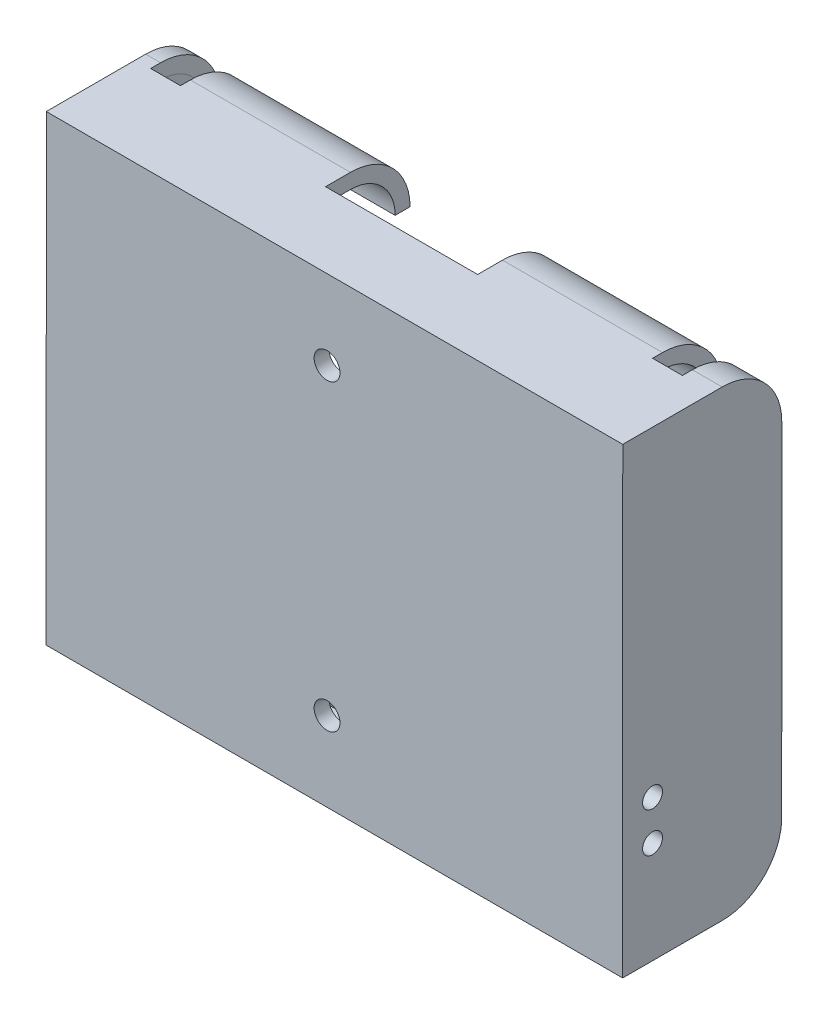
ISO-10303-21;
HEADER;
FILE_DESCRIPTION(('STEP AP214'),'2;1');
FILE_NAME('part.step','',(''),(''),'','','');
FILE_SCHEMA(('AUTOMOTIVE_DESIGN { 1 0 10303 214 1 1 1 1 }'));
ENDSEC;
DATA;
#1=APPLICATION_CONTEXT('core data for automotive mechanical design processes');
#2=APPLICATION_PROTOCOL_DEFINITION('international standard','automotive_design',2000,#1);
#3=PRODUCT_CONTEXT('',#1,'mechanical');
#4=PRODUCT('Part','Part','',(#3));
#5=PRODUCT_RELATED_PRODUCT_CATEGORY('part','',(#4));
#6=PRODUCT_DEFINITION_FORMATION('','',#4);
#7=PRODUCT_DEFINITION_CONTEXT('part definition',#1,'design');
#8=PRODUCT_DEFINITION('design','',#6,#7);
#9=PRODUCT_DEFINITION_SHAPE('','',#8);
#10=(LENGTH_UNIT() NAMED_UNIT(*) SI_UNIT(.MILLI.,.METRE.));
#11=(NAMED_UNIT(*) PLANE_ANGLE_UNIT() SI_UNIT($,.RADIAN.));
#12=(NAMED_UNIT(*) SI_UNIT($,.STERADIAN.) SOLID_ANGLE_UNIT());
#13=UNCERTAINTY_MEASURE_WITH_UNIT(LENGTH_MEASURE(1.E-05),#10,'distance_accuracy_value','');
#14=(GEOMETRIC_REPRESENTATION_CONTEXT(3) GLOBAL_UNCERTAINTY_ASSIGNED_CONTEXT((#13)) GLOBAL_UNIT_ASSIGNED_CONTEXT((#10,
#11,#12)) REPRESENTATION_CONTEXT('',''));
#15=CARTESIAN_POINT('',(0.,0.,0.));
#16=DIRECTION('',(0.,0.,1.));
#17=DIRECTION('',(1.,0.,0.));
#18=AXIS2_PLACEMENT_3D('',#15,#16,#17);
#19=CARTESIAN_POINT('',(-28.2545936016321,-6.25000001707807,-10.));
#20=DIRECTION('',(-1.,0.,0.));
#21=DIRECTION('',(0.,0.,1.));
#22=AXIS2_PLACEMENT_3D('',#19,#20,#21);
#23=CYLINDRICAL_SURFACE('',#22,6.);
#24=CARTESIAN_POINT('',(-7.65,-6.25000001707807,-10.));
#25=DIRECTION('',(-1.,0.,0.));
#26=DIRECTION('',(0.,-1.,0.));
#27=AXIS2_PLACEMENT_3D('',#24,#25,#26);
#28=CIRCLE('',#27,6.);
#29=CARTESIAN_POINT('',(-7.65,-12.2500000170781,-10.));
#30=VERTEX_POINT('',#29);
#31=CARTESIAN_POINT('',(-7.65,-6.25000001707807,-16.));
#32=VERTEX_POINT('',#31);
#33=EDGE_CURVE('E492',#30,#32,#28,.F.);
#34=ORIENTED_EDGE('',*,*,#33,.F.);
#35=DIRECTION('',(1.,0.,0.));
#36=VECTOR('',#35,1.);
#37=CARTESIAN_POINT('',(29.7454063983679,-12.2500000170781,-10.));
#38=LINE('',#37,#36);
#39=CARTESIAN_POINT('',(-23.75,-12.2500000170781,-10.));
#40=VERTEX_POINT('',#39);
#41=EDGE_CURVE('E385',#40,#30,#38,.T.);
#42=ORIENTED_EDGE('',*,*,#41,.F.);
#43=CARTESIAN_POINT('',(-23.75,-6.25000001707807,-10.));
#44=DIRECTION('',(1.,0.,0.));
#45=DIRECTION('',(0.,1.,0.));
#46=AXIS2_PLACEMENT_3D('',#43,#44,#45);
#47=CIRCLE('',#46,6.);
#48=CARTESIAN_POINT('',(-23.75,-6.25000001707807,-16.));
#49=VERTEX_POINT('',#48);
#50=EDGE_CURVE('E566',#49,#40,#47,.F.);
#51=ORIENTED_EDGE('',*,*,#50,.F.);
#52=DIRECTION('',(1.,0.,0.));
#53=VECTOR('',#52,1.);
#54=CARTESIAN_POINT('',(-28.2545936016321,-6.25000001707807,-16.));
#55=LINE('',#54,#53);
#56=EDGE_CURVE('E583',#32,#49,#55,.F.);
#57=ORIENTED_EDGE('',*,*,#56,.F.);
#58=EDGE_LOOP('',(#34,#42,#51,#57));
#59=FACE_BOUND('',#58,.T.);
#60=ADVANCED_FACE('F43',(#59),#23,.T.);
#61=CARTESIAN_POINT('',(26.75,-6.25000001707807,-10.));
#62=DIRECTION('',(1.,0.,0.));
#63=DIRECTION('',(0.,1.,0.));
#64=AXIS2_PLACEMENT_3D('',#61,#62,#63);
#65=CIRCLE('',#64,6.);
#66=CARTESIAN_POINT('',(26.75,-6.25000001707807,-16.));
#67=VERTEX_POINT('',#66);
#68=CARTESIAN_POINT('',(26.75,-12.2500000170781,-10.));
#69=VERTEX_POINT('',#68);
#70=EDGE_CURVE('E451',#67,#69,#65,.F.);
#71=ORIENTED_EDGE('',*,*,#70,.F.);
#72=CARTESIAN_POINT('',(28.2459991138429,-6.25000001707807,-16.));
#73=VERTEX_POINT('',#72);
#74=EDGE_CURVE('E578',#73,#67,#55,.F.);
#75=ORIENTED_EDGE('',*,*,#74,.F.);
#76=DIRECTION('',(1.,0.,0.));
#77=VECTOR('',#76,1.);
#78=CARTESIAN_POINT('',(-28.2545936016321,-6.25000001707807,-16.));
#79=LINE('',#78,#77);
#80=CARTESIAN_POINT('',(29.745999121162,-6.25000001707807,-16.));
#81=VERTEX_POINT('',#80);
#82=EDGE_CURVE('E690',#81,#73,#79,.F.);
#83=ORIENTED_EDGE('',*,*,#82,.F.);
#84=CARTESIAN_POINT('',(29.745999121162,-6.25000001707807,-10.));
#85=DIRECTION('',(0.999999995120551,-9.87871318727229E-05,0.));
#86=DIRECTION('',(-9.87871318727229E-05,-0.999999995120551,0.));
#87=AXIS2_PLACEMENT_3D('',#84,#85,#86);
#88=ELLIPSE('',#87,6.00000002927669,6.);
#89=CARTESIAN_POINT('',(29.7454063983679,-12.2500000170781,-10.));
#90=VERTEX_POINT('',#89);
#91=EDGE_CURVE('E683',#90,#81,#88,.T.);
#92=ORIENTED_EDGE('',*,*,#91,.F.);
#93=EDGE_CURVE('E672',#69,#90,#38,.T.);
#94=ORIENTED_EDGE('',*,*,#93,.F.);
#95=EDGE_LOOP('',(#71,#75,#83,#92,#94));
#96=FACE_BOUND('',#95,.T.);
#97=ADVANCED_FACE('F826',(#96),#23,.T.);
#98=CARTESIAN_POINT('',(-28.25,28.2499997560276,-10.));
#99=DIRECTION('',(1.,0.,0.));
#100=DIRECTION('',(0.,1.,0.));
#101=AXIS2_PLACEMENT_3D('',#98,#99,#100);
#102=CYLINDRICAL_SURFACE('',#101,6.);
#103=CARTESIAN_POINT('',(-7.65,28.2499997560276,-10.));
#104=DIRECTION('',(-1.,0.,0.));
#105=DIRECTION('',(0.,-1.,0.));
#106=AXIS2_PLACEMENT_3D('',#103,#104,#105);
#107=CIRCLE('',#106,6.);
#108=CARTESIAN_POINT('',(-7.65,28.2499997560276,-16.));
#109=VERTEX_POINT('',#108);
#110=CARTESIAN_POINT('',(-7.65,34.2499997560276,-10.));
#111=VERTEX_POINT('',#110);
#112=EDGE_CURVE('E503',#109,#111,#107,.F.);
#113=ORIENTED_EDGE('',*,*,#112,.F.);
#114=DIRECTION('',(-1.,0.,0.));
#115=VECTOR('',#114,1.);
#116=CARTESIAN_POINT('',(29.75,28.2499997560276,-16.));
#117=LINE('',#116,#115);
#118=CARTESIAN_POINT('',(-23.75,28.2499997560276,-16.));
#119=VERTEX_POINT('',#118);
#120=EDGE_CURVE('E576',#119,#109,#117,.F.);
#121=ORIENTED_EDGE('',*,*,#120,.F.);
#122=CARTESIAN_POINT('',(-23.75,28.2499997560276,-10.));
#123=DIRECTION('',(1.,0.,0.));
#124=DIRECTION('',(0.,1.,0.));
#125=AXIS2_PLACEMENT_3D('',#122,#123,#124);
#126=CIRCLE('',#125,6.);
#127=CARTESIAN_POINT('',(-23.75,34.2499997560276,-10.));
#128=VERTEX_POINT('',#127);
#129=EDGE_CURVE('E555',#128,#119,#126,.F.);
#130=ORIENTED_EDGE('',*,*,#129,.F.);
#131=DIRECTION('',(-1.,0.,0.));
#132=VECTOR('',#131,1.);
#133=CARTESIAN_POINT('',(-28.25,34.2499997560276,-10.));
#134=LINE('',#133,#132);
#135=EDGE_CURVE('E703',#111,#128,#134,.T.);
#136=ORIENTED_EDGE('',*,*,#135,.F.);
#137=EDGE_LOOP('',(#113,#121,#130,#136));
#138=FACE_BOUND('',#137,.T.);
#139=ADVANCED_FACE('F892',(#138),#102,.T.);
#140=CARTESIAN_POINT('',(26.75,28.2499997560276,-10.));
#141=DIRECTION('',(1.,0.,0.));
#142=DIRECTION('',(0.,1.,0.));
#143=AXIS2_PLACEMENT_3D('',#140,#141,#142);
#144=CIRCLE('',#143,6.);
#145=CARTESIAN_POINT('',(26.75,34.2499997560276,-10.));
#146=VERTEX_POINT('',#145);
#147=CARTESIAN_POINT('',(26.75,28.2499997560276,-16.));
#148=VERTEX_POINT('',#147);
#149=EDGE_CURVE('E462',#146,#148,#144,.F.);
#150=ORIENTED_EDGE('',*,*,#149,.F.);
#151=CARTESIAN_POINT('',(29.75,34.2499997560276,-10.));
#152=VERTEX_POINT('',#151);
#153=EDGE_CURVE('E698',#152,#146,#134,.T.);
#154=ORIENTED_EDGE('',*,*,#153,.F.);
#155=CARTESIAN_POINT('',(29.7494072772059,28.2499997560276,-10.));
#156=DIRECTION('',(0.999999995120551,-9.87871318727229E-05,0.));
#157=DIRECTION('',(9.87871318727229E-05,0.999999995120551,0.));
#158=AXIS2_PLACEMENT_3D('',#155,#156,#157);
#159=ELLIPSE('',#158,6.00000002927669,6.);
#160=CARTESIAN_POINT('',(29.7494072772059,28.2499997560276,-16.));
#161=VERTEX_POINT('',#160);
#162=EDGE_CURVE('E681',#161,#152,#159,.T.);
#163=ORIENTED_EDGE('',*,*,#162,.F.);
#164=DIRECTION('',(-1.,0.,0.));
#165=VECTOR('',#164,1.);
#166=CARTESIAN_POINT('',(29.75,28.2499997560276,-16.));
#167=LINE('',#166,#165);
#168=CARTESIAN_POINT('',(28.2494072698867,28.2499997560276,-16.));
#169=VERTEX_POINT('',#168);
#170=EDGE_CURVE('E685',#169,#161,#167,.F.);
#171=ORIENTED_EDGE('',*,*,#170,.F.);
#172=EDGE_CURVE('E577',#148,#169,#117,.F.);
#173=ORIENTED_EDGE('',*,*,#172,.F.);
#174=EDGE_LOOP('',(#150,#154,#163,#171,#173));
#175=FACE_BOUND('',#174,.T.);
#176=ADVANCED_FACE('F912',(#175),#102,.T.);
#177=CARTESIAN_POINT('',(29.75,28.2499997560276,-16.));
#178=DIRECTION('',(0.,1.,0.));
#179=DIRECTION('',(-1.,0.,0.));
#180=AXIS2_PLACEMENT_3D('',#177,#178,#179);
#181=PLANE('',#180);
#182=ORIENTED_EDGE('',*,*,#120,.T.);
#183=DIRECTION('',(0.,0.,1.));
#184=VECTOR('',#183,1.);
#185=CARTESIAN_POINT('',(-7.65,28.2499997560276,-16.));
#186=LINE('',#185,#184);
#187=CARTESIAN_POINT('',(-7.65,28.2499997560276,-14.5));
#188=VERTEX_POINT('',#187);
#189=EDGE_CURVE('E500',#109,#188,#186,.T.);
#190=ORIENTED_EDGE('',*,*,#189,.T.);
#191=DIRECTION('',(1.,0.,0.));
#192=VECTOR('',#191,1.);
#193=CARTESIAN_POINT('',(0.74940727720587,28.2499997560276,-14.5));
#194=LINE('',#193,#192);
#195=CARTESIAN_POINT('',(-23.75,28.2499997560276,-14.5));
#196=VERTEX_POINT('',#195);
#197=EDGE_CURVE('E636',#196,#188,#194,.T.);
#198=ORIENTED_EDGE('',*,*,#197,.F.);
#199=DIRECTION('',(0.,0.,-1.));
#200=VECTOR('',#199,1.);
#201=CARTESIAN_POINT('',(-23.75,28.2499997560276,-16.));
#202=LINE('',#201,#200);
#203=EDGE_CURVE('E552',#196,#119,#202,.T.);
#204=ORIENTED_EDGE('',*,*,#203,.T.);
#205=EDGE_LOOP('',(#182,#190,#198,#204));
#206=FACE_BOUND('',#205,.T.);
#207=ADVANCED_FACE('F1026',(#206),#181,.F.);
#208=CARTESIAN_POINT('',(26.75,28.2499997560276,-14.5));
#209=VERTEX_POINT('',#208);
#210=CARTESIAN_POINT('',(28.2494072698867,28.2499997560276,-14.5));
#211=VERTEX_POINT('',#210);
#212=EDGE_CURVE('E637',#209,#211,#194,.T.);
#213=ORIENTED_EDGE('',*,*,#212,.F.);
#214=DIRECTION('',(0.,0.,-1.));
#215=VECTOR('',#214,1.);
#216=CARTESIAN_POINT('',(26.75,28.2499997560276,-16.));
#217=LINE('',#216,#215);
#218=EDGE_CURVE('E459',#209,#148,#217,.T.);
#219=ORIENTED_EDGE('',*,*,#218,.T.);
#220=ORIENTED_EDGE('',*,*,#172,.T.);
#221=DIRECTION('',(0.,0.,-1.));
#222=VECTOR('',#221,1.);
#223=CARTESIAN_POINT('',(28.2494072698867,28.2499997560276,-16.));
#224=LINE('',#223,#222);
#225=EDGE_CURVE('E631',#211,#169,#224,.T.);
#226=ORIENTED_EDGE('',*,*,#225,.F.);
#227=EDGE_LOOP('',(#213,#219,#220,#226));
#228=FACE_BOUND('',#227,.T.);
#229=ADVANCED_FACE('F974',(#228),#181,.F.);
#230=CARTESIAN_POINT('',(-28.2545936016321,-6.25000001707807,-16.));
#231=DIRECTION('',(0.,-1.,0.));
#232=DIRECTION('',(1.,0.,0.));
#233=AXIS2_PLACEMENT_3D('',#230,#231,#232);
#234=PLANE('',#233);
#235=DIRECTION('',(-1.,0.,0.));
#236=VECTOR('',#235,1.);
#237=CARTESIAN_POINT('',(0.745999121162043,-6.25000001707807,-14.5));
#238=LINE('',#237,#236);
#239=CARTESIAN_POINT('',(-7.65,-6.25000001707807,-14.5));
#240=VERTEX_POINT('',#239);
#241=CARTESIAN_POINT('',(-23.75,-6.25000001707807,-14.5));
#242=VERTEX_POINT('',#241);
#243=EDGE_CURVE('E649',#240,#242,#238,.T.);
#244=ORIENTED_EDGE('',*,*,#243,.F.);
#245=DIRECTION('',(0.,0.,-1.));
#246=VECTOR('',#245,1.);
#247=CARTESIAN_POINT('',(-7.65,-6.25000001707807,-16.));
#248=LINE('',#247,#246);
#249=EDGE_CURVE('E489',#240,#32,#248,.T.);
#250=ORIENTED_EDGE('',*,*,#249,.T.);
#251=ORIENTED_EDGE('',*,*,#56,.T.);
#252=DIRECTION('',(0.,0.,1.));
#253=VECTOR('',#252,1.);
#254=CARTESIAN_POINT('',(-23.75,-6.25000001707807,-16.));
#255=LINE('',#254,#253);
#256=EDGE_CURVE('E563',#49,#242,#255,.T.);
#257=ORIENTED_EDGE('',*,*,#256,.T.);
#258=EDGE_LOOP('',(#244,#250,#251,#257));
#259=FACE_BOUND('',#258,.T.);
#260=ADVANCED_FACE('F855',(#259),#234,.F.);
#261=ORIENTED_EDGE('',*,*,#74,.T.);
#262=DIRECTION('',(0.,0.,1.));
#263=VECTOR('',#262,1.);
#264=CARTESIAN_POINT('',(26.75,-6.25000001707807,-16.));
#265=LINE('',#264,#263);
#266=CARTESIAN_POINT('',(26.75,-6.25000001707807,-14.5));
#267=VERTEX_POINT('',#266);
#268=EDGE_CURVE('E448',#67,#267,#265,.T.);
#269=ORIENTED_EDGE('',*,*,#268,.T.);
#270=CARTESIAN_POINT('',(28.2459991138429,-6.25000001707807,-14.5));
#271=VERTEX_POINT('',#270);
#272=EDGE_CURVE('E645',#271,#267,#238,.T.);
#273=ORIENTED_EDGE('',*,*,#272,.F.);
#274=DIRECTION('',(0.,0.,-1.));
#275=VECTOR('',#274,1.);
#276=CARTESIAN_POINT('',(28.2459991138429,-6.25000001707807,-16.));
#277=LINE('',#276,#275);
#278=EDGE_CURVE('E640',#271,#73,#277,.T.);
#279=ORIENTED_EDGE('',*,*,#278,.T.);
#280=EDGE_LOOP('',(#261,#269,#273,#279));
#281=FACE_BOUND('',#280,.T.);
#282=ADVANCED_FACE('F870',(#281),#234,.F.);
#283=CARTESIAN_POINT('',(-28.2545936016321,-6.25000001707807,-10.));
#284=DIRECTION('',(-1.,0.,0.));
#285=DIRECTION('',(0.,0.,1.));
#286=AXIS2_PLACEMENT_3D('',#283,#284,#285);
#287=CYLINDRICAL_SURFACE('',#286,4.5);
#288=DIRECTION('',(1.,0.,0.));
#289=VECTOR('',#288,1.);
#290=CARTESIAN_POINT('',(-28.2545936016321,-10.7500000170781,-10.));
#291=LINE('',#290,#289);
#292=CARTESIAN_POINT('',(-23.75,-10.7500000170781,-10.));
#293=VERTEX_POINT('',#292);
#294=CARTESIAN_POINT('',(-7.65,-10.7500000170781,-10.));
#295=VERTEX_POINT('',#294);
#296=EDGE_CURVE('E623',#293,#295,#291,.T.);
#297=ORIENTED_EDGE('',*,*,#296,.T.);
#298=CARTESIAN_POINT('',(-7.65,-6.25000001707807,-10.));
#299=DIRECTION('',(-1.,0.,0.));
#300=DIRECTION('',(0.,-1.,0.));
#301=AXIS2_PLACEMENT_3D('',#298,#299,#300);
#302=CIRCLE('',#301,4.5);
#303=EDGE_CURVE('E486',#295,#240,#302,.F.);
#304=ORIENTED_EDGE('',*,*,#303,.T.);
#305=ORIENTED_EDGE('',*,*,#243,.T.);
#306=CARTESIAN_POINT('',(-23.75,-6.25000001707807,-10.));
#307=DIRECTION('',(1.,0.,0.));
#308=DIRECTION('',(0.,1.,0.));
#309=AXIS2_PLACEMENT_3D('',#306,#307,#308);
#310=CIRCLE('',#309,4.5);
#311=EDGE_CURVE('E557',#242,#293,#310,.F.);
#312=ORIENTED_EDGE('',*,*,#311,.T.);
#313=EDGE_LOOP('',(#297,#304,#305,#312));
#314=FACE_BOUND('',#313,.T.);
#315=ADVANCED_FACE('F876',(#314),#287,.F.);
#316=ORIENTED_EDGE('',*,*,#272,.T.);
#317=CARTESIAN_POINT('',(26.75,-6.25000001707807,-10.));
#318=DIRECTION('',(1.,0.,0.));
#319=DIRECTION('',(0.,1.,0.));
#320=AXIS2_PLACEMENT_3D('',#317,#318,#319);
#321=CIRCLE('',#320,4.5);
#322=CARTESIAN_POINT('',(26.75,-10.7500000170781,-10.));
#323=VERTEX_POINT('',#322);
#324=EDGE_CURVE('E445',#267,#323,#321,.F.);
#325=ORIENTED_EDGE('',*,*,#324,.T.);
#326=CARTESIAN_POINT('',(28.2455545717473,-10.7500000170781,-10.));
#327=VERTEX_POINT('',#326);
#328=EDGE_CURVE('E596',#323,#327,#291,.T.);
#329=ORIENTED_EDGE('',*,*,#328,.T.);
#330=CARTESIAN_POINT('',(28.2459991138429,-6.25000001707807,-10.));
#331=DIRECTION('',(0.999999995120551,-9.87871318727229E-05,0.));
#332=DIRECTION('',(-9.87871318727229E-05,-0.999999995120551,0.));
#333=AXIS2_PLACEMENT_3D('',#330,#331,#332);
#334=ELLIPSE('',#333,4.50000002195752,4.5);
#335=EDGE_CURVE('E613',#327,#271,#334,.T.);
#336=ORIENTED_EDGE('',*,*,#335,.T.);
#337=EDGE_LOOP('',(#316,#325,#329,#336));
#338=FACE_BOUND('',#337,.T.);
#339=ADVANCED_FACE('F873',(#338),#287,.F.);
#340=CARTESIAN_POINT('',(-28.25,28.2499997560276,-10.));
#341=DIRECTION('',(1.,0.,0.));
#342=DIRECTION('',(0.,1.,0.));
#343=AXIS2_PLACEMENT_3D('',#340,#341,#342);
#344=CYLINDRICAL_SURFACE('',#343,4.5);
#345=ORIENTED_EDGE('',*,*,#197,.T.);
#346=CARTESIAN_POINT('',(-7.65,28.2499997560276,-10.));
#347=DIRECTION('',(-1.,0.,0.));
#348=DIRECTION('',(0.,-1.,0.));
#349=AXIS2_PLACEMENT_3D('',#346,#347,#348);
#350=CIRCLE('',#349,4.5);
#351=CARTESIAN_POINT('',(-7.64999999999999,32.7499997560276,-10.));
#352=VERTEX_POINT('',#351);
#353=EDGE_CURVE('E497',#188,#352,#350,.F.);
#354=ORIENTED_EDGE('',*,*,#353,.T.);
#355=DIRECTION('',(-1.,0.,0.));
#356=VECTOR('',#355,1.);
#357=CARTESIAN_POINT('',(-28.25,32.7499997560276,-10.));
#358=LINE('',#357,#356);
#359=CARTESIAN_POINT('',(-23.75,32.7499997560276,-10.));
#360=VERTEX_POINT('',#359);
#361=EDGE_CURVE('E606',#352,#360,#358,.T.);
#362=ORIENTED_EDGE('',*,*,#361,.T.);
#363=CARTESIAN_POINT('',(-23.75,28.2499997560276,-10.));
#364=DIRECTION('',(1.,0.,0.));
#365=DIRECTION('',(0.,1.,0.));
#366=AXIS2_PLACEMENT_3D('',#363,#364,#365);
#367=CIRCLE('',#366,4.5);
#368=EDGE_CURVE('E706',#360,#196,#367,.F.);
#369=ORIENTED_EDGE('',*,*,#368,.T.);
#370=EDGE_LOOP('',(#345,#354,#362,#369));
#371=FACE_BOUND('',#370,.T.);
#372=ADVANCED_FACE('F883',(#371),#344,.F.);
#373=CARTESIAN_POINT('',(28.2498518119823,32.7499997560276,-10.));
#374=VERTEX_POINT('',#373);
#375=CARTESIAN_POINT('',(26.75,32.7499997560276,-10.));
#376=VERTEX_POINT('',#375);
#377=EDGE_CURVE('E601',#374,#376,#358,.T.);
#378=ORIENTED_EDGE('',*,*,#377,.T.);
#379=CARTESIAN_POINT('',(26.75,28.2499997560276,-10.));
#380=DIRECTION('',(1.,0.,0.));
#381=DIRECTION('',(0.,1.,0.));
#382=AXIS2_PLACEMENT_3D('',#379,#380,#381);
#383=CIRCLE('',#382,4.5);
#384=EDGE_CURVE('E456',#376,#209,#383,.F.);
#385=ORIENTED_EDGE('',*,*,#384,.T.);
#386=ORIENTED_EDGE('',*,*,#212,.T.);
#387=CARTESIAN_POINT('',(28.2494072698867,28.2499997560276,-10.));
#388=DIRECTION('',(0.999999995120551,-9.87871318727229E-05,0.));
#389=DIRECTION('',(9.87871318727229E-05,0.999999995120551,0.));
#390=AXIS2_PLACEMENT_3D('',#387,#388,#389);
#391=ELLIPSE('',#390,4.50000002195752,4.5);
#392=EDGE_CURVE('E616',#211,#374,#391,.T.);
#393=ORIENTED_EDGE('',*,*,#392,.T.);
#394=EDGE_LOOP('',(#378,#385,#386,#393));
#395=FACE_BOUND('',#394,.T.);
#396=ADVANCED_FACE('F905',(#395),#344,.F.);
#397=CARTESIAN_POINT('',(7.65,-6.25000001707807,-10.));
#398=DIRECTION('',(1.,0.,0.));
#399=DIRECTION('',(0.,1.,0.));
#400=AXIS2_PLACEMENT_3D('',#397,#398,#399);
#401=CIRCLE('',#400,6.);
#402=CARTESIAN_POINT('',(7.65,-6.25000001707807,-16.));
#403=VERTEX_POINT('',#402);
#404=CARTESIAN_POINT('',(7.65,-12.2500000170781,-10.));
#405=VERTEX_POINT('',#404);
#406=EDGE_CURVE('E473',#403,#405,#401,.F.);
#407=ORIENTED_EDGE('',*,*,#406,.F.);
#408=CARTESIAN_POINT('',(23.75,-6.25000001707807,-16.));
#409=VERTEX_POINT('',#408);
#410=EDGE_CURVE('E582',#409,#403,#55,.F.);
#411=ORIENTED_EDGE('',*,*,#410,.F.);
#412=CARTESIAN_POINT('',(23.75,-6.25000001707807,-10.));
#413=DIRECTION('',(-1.,0.,0.));
#414=DIRECTION('',(0.,-1.,0.));
#415=AXIS2_PLACEMENT_3D('',#412,#413,#414);
#416=CIRCLE('',#415,6.);
#417=CARTESIAN_POINT('',(23.75,-12.2500000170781,-10.));
#418=VERTEX_POINT('',#417);
#419=EDGE_CURVE('E429',#418,#409,#416,.F.);
#420=ORIENTED_EDGE('',*,*,#419,.F.);
#421=EDGE_CURVE('E814',#405,#418,#38,.T.);
#422=ORIENTED_EDGE('',*,*,#421,.F.);
#423=EDGE_LOOP('',(#407,#411,#420,#422));
#424=FACE_BOUND('',#423,.T.);
#425=ADVANCED_FACE('F811',(#424),#23,.T.);
#426=CARTESIAN_POINT('',(7.65,28.2499997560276,-10.));
#427=DIRECTION('',(1.,0.,0.));
#428=DIRECTION('',(0.,1.,0.));
#429=AXIS2_PLACEMENT_3D('',#426,#427,#428);
#430=CIRCLE('',#429,6.);
#431=CARTESIAN_POINT('',(7.65,34.2499997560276,-10.));
#432=VERTEX_POINT('',#431);
#433=CARTESIAN_POINT('',(7.65,28.2499997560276,-16.));
#434=VERTEX_POINT('',#433);
#435=EDGE_CURVE('E484',#432,#434,#430,.F.);
#436=ORIENTED_EDGE('',*,*,#435,.F.);
#437=CARTESIAN_POINT('',(23.75,34.2499997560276,-10.));
#438=VERTEX_POINT('',#437);
#439=EDGE_CURVE('E702',#438,#432,#134,.T.);
#440=ORIENTED_EDGE('',*,*,#439,.F.);
#441=CARTESIAN_POINT('',(23.75,28.2499997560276,-10.));
#442=DIRECTION('',(-1.,0.,0.));
#443=DIRECTION('',(0.,-1.,0.));
#444=AXIS2_PLACEMENT_3D('',#441,#442,#443);
#445=CIRCLE('',#444,6.);
#446=CARTESIAN_POINT('',(23.75,28.2499997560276,-16.));
#447=VERTEX_POINT('',#446);
#448=EDGE_CURVE('E440',#447,#438,#445,.F.);
#449=ORIENTED_EDGE('',*,*,#448,.F.);
#450=EDGE_CURVE('E963',#434,#447,#117,.F.);
#451=ORIENTED_EDGE('',*,*,#450,.F.);
#452=EDGE_LOOP('',(#436,#440,#449,#451));
#453=FACE_BOUND('',#452,.T.);
#454=ADVANCED_FACE('F901',(#453),#102,.T.);
#455=CARTESIAN_POINT('',(7.65,28.2499997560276,-14.5));
#456=VERTEX_POINT('',#455);
#457=CARTESIAN_POINT('',(23.75,28.2499997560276,-14.5));
#458=VERTEX_POINT('',#457);
#459=EDGE_CURVE('E969',#456,#458,#194,.T.);
#460=ORIENTED_EDGE('',*,*,#459,.F.);
#461=DIRECTION('',(0.,0.,-1.));
#462=VECTOR('',#461,1.);
#463=CARTESIAN_POINT('',(7.65,28.2499997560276,-16.));
#464=LINE('',#463,#462);
#465=EDGE_CURVE('E481',#456,#434,#464,.T.);
#466=ORIENTED_EDGE('',*,*,#465,.T.);
#467=ORIENTED_EDGE('',*,*,#450,.T.);
#468=DIRECTION('',(0.,0.,1.));
#469=VECTOR('',#468,1.);
#470=CARTESIAN_POINT('',(23.75,28.2499997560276,-16.));
#471=LINE('',#470,#469);
#472=EDGE_CURVE('E437',#447,#458,#471,.T.);
#473=ORIENTED_EDGE('',*,*,#472,.T.);
#474=EDGE_LOOP('',(#460,#466,#467,#473));
#475=FACE_BOUND('',#474,.T.);
#476=ADVANCED_FACE('F910',(#475),#181,.F.);
#477=ORIENTED_EDGE('',*,*,#410,.T.);
#478=DIRECTION('',(0.,0.,1.));
#479=VECTOR('',#478,1.);
#480=CARTESIAN_POINT('',(7.65,-6.25000001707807,-16.));
#481=LINE('',#480,#479);
#482=CARTESIAN_POINT('',(7.65,-6.25000001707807,-14.5));
#483=VERTEX_POINT('',#482);
#484=EDGE_CURVE('E470',#403,#483,#481,.T.);
#485=ORIENTED_EDGE('',*,*,#484,.T.);
#486=CARTESIAN_POINT('',(23.75,-6.25000001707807,-14.5));
#487=VERTEX_POINT('',#486);
#488=EDGE_CURVE('E648',#487,#483,#238,.T.);
#489=ORIENTED_EDGE('',*,*,#488,.F.);
#490=DIRECTION('',(0.,0.,-1.));
#491=VECTOR('',#490,1.);
#492=CARTESIAN_POINT('',(23.75,-6.25000001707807,-16.));
#493=LINE('',#492,#491);
#494=EDGE_CURVE('E426',#487,#409,#493,.T.);
#495=ORIENTED_EDGE('',*,*,#494,.T.);
#496=EDGE_LOOP('',(#477,#485,#489,#495));
#497=FACE_BOUND('',#496,.T.);
#498=ADVANCED_FACE('F805',(#497),#234,.F.);
#499=ORIENTED_EDGE('',*,*,#488,.T.);
#500=CARTESIAN_POINT('',(7.65,-6.25000001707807,-10.));
#501=DIRECTION('',(1.,0.,0.));
#502=DIRECTION('',(0.,1.,0.));
#503=AXIS2_PLACEMENT_3D('',#500,#501,#502);
#504=CIRCLE('',#503,4.5);
#505=CARTESIAN_POINT('',(7.65,-10.7500000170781,-10.));
#506=VERTEX_POINT('',#505);
#507=EDGE_CURVE('E467',#483,#506,#504,.F.);
#508=ORIENTED_EDGE('',*,*,#507,.T.);
#509=CARTESIAN_POINT('',(23.75,-10.7500000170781,-10.));
#510=VERTEX_POINT('',#509);
#511=EDGE_CURVE('E861',#506,#510,#291,.T.);
#512=ORIENTED_EDGE('',*,*,#511,.T.);
#513=CARTESIAN_POINT('',(23.75,-6.25000001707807,-10.));
#514=DIRECTION('',(-1.,0.,0.));
#515=DIRECTION('',(0.,-1.,0.));
#516=AXIS2_PLACEMENT_3D('',#513,#514,#515);
#517=CIRCLE('',#516,4.5);
#518=EDGE_CURVE('E399',#510,#487,#517,.F.);
#519=ORIENTED_EDGE('',*,*,#518,.T.);
#520=EDGE_LOOP('',(#499,#508,#512,#519));
#521=FACE_BOUND('',#520,.T.);
#522=ADVANCED_FACE('F858',(#521),#287,.F.);
#523=CARTESIAN_POINT('',(23.75,32.7499997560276,-10.));
#524=VERTEX_POINT('',#523);
#525=CARTESIAN_POINT('',(7.65,32.7499997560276,-10.));
#526=VERTEX_POINT('',#525);
#527=EDGE_CURVE('E605',#524,#526,#358,.T.);
#528=ORIENTED_EDGE('',*,*,#527,.T.);
#529=CARTESIAN_POINT('',(7.65,28.2499997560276,-10.));
#530=DIRECTION('',(1.,0.,0.));
#531=DIRECTION('',(0.,1.,0.));
#532=AXIS2_PLACEMENT_3D('',#529,#530,#531);
#533=CIRCLE('',#532,4.5);
#534=EDGE_CURVE('E478',#526,#456,#533,.F.);
#535=ORIENTED_EDGE('',*,*,#534,.T.);
#536=ORIENTED_EDGE('',*,*,#459,.T.);
#537=CARTESIAN_POINT('',(23.75,28.2499997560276,-10.));
#538=DIRECTION('',(-1.,0.,0.));
#539=DIRECTION('',(0.,-1.,0.));
#540=AXIS2_PLACEMENT_3D('',#537,#538,#539);
#541=CIRCLE('',#540,4.5);
#542=EDGE_CURVE('E434',#458,#524,#541,.F.);
#543=ORIENTED_EDGE('',*,*,#542,.T.);
#544=EDGE_LOOP('',(#528,#535,#536,#543));
#545=FACE_BOUND('',#544,.T.);
#546=ADVANCED_FACE('F914',(#545),#344,.F.);
#547=CARTESIAN_POINT('',(-28.25,34.2499997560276,-16.));
#548=DIRECTION('',(0.,0.,1.));
#549=DIRECTION('',(1.,0.,0.));
#550=AXIS2_PLACEMENT_3D('',#547,#548,#549);
#551=PLANE('',#550);
#552=ORIENTED_EDGE('',*,*,#82,.T.);
#553=DIRECTION('',(9.87871318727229E-05,0.999999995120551,0.));
#554=VECTOR('',#553,1.);
#555=CARTESIAN_POINT('',(28.2499994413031,34.2444182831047,-16.));
#556=LINE('',#555,#554);
#557=EDGE_CURVE('E590',#73,#169,#556,.T.);
#558=ORIENTED_EDGE('',*,*,#557,.T.);
#559=ORIENTED_EDGE('',*,*,#170,.T.);
#560=DIRECTION('',(9.87871318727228E-05,0.999999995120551,0.));
#561=VECTOR('',#560,1.);
#562=CARTESIAN_POINT('',(29.75,34.2499997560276,-16.));
#563=LINE('',#562,#561);
#564=EDGE_CURVE('E655',#81,#161,#563,.T.);
#565=ORIENTED_EDGE('',*,*,#564,.F.);
#566=EDGE_LOOP('',(#552,#558,#559,#565));
#567=FACE_BOUND('',#566,.T.);
#568=ADVANCED_FACE('F921',(#567),#551,.F.);
#569=CARTESIAN_POINT('',(-28.25,34.2499997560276,-16.));
#570=DIRECTION('',(-0.999999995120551,9.87871318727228E-05,0.));
#571=DIRECTION('',(-9.87871318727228E-05,-0.999999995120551,0.));
#572=AXIS2_PLACEMENT_3D('',#569,#570,#571);
#573=PLANE('',#572);
#574=DIRECTION('',(-9.87871318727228E-05,-0.999999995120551,0.));
#575=VECTOR('',#574,1.);
#576=CARTESIAN_POINT('',(-28.25,34.2499997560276,-16.));
#577=LINE('',#576,#575);
#578=CARTESIAN_POINT('',(-28.2505927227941,28.2499997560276,-16.));
#579=VERTEX_POINT('',#578);
#580=CARTESIAN_POINT('',(-28.254000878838,-6.25000001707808,-16.));
#581=VERTEX_POINT('',#580);
#582=EDGE_CURVE('E652',#579,#581,#577,.T.);
#583=ORIENTED_EDGE('',*,*,#582,.T.);
#584=CARTESIAN_POINT('',(-28.254000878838,-6.25000001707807,-10.));
#585=DIRECTION('',(-0.999999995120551,9.87871318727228E-05,0.));
#586=DIRECTION('',(-9.87871318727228E-05,-0.999999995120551,0.));
#587=AXIS2_PLACEMENT_3D('',#584,#585,#586);
#588=ELLIPSE('',#587,6.00000002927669,6.);
#589=CARTESIAN_POINT('',(-28.2545936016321,-12.2500000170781,-10.));
#590=VERTEX_POINT('',#589);
#591=EDGE_CURVE('E695',#581,#590,#588,.T.);
#592=ORIENTED_EDGE('',*,*,#591,.T.);
#593=DIRECTION('',(0.,0.,1.));
#594=VECTOR('',#593,1.);
#595=CARTESIAN_POINT('',(-28.2545936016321,-12.2500000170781,-16.));
#596=LINE('',#595,#594);
#597=CARTESIAN_POINT('',(-28.2545936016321,-12.2500000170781,0.));
#598=VERTEX_POINT('',#597);
#599=EDGE_CURVE('E659',#590,#598,#596,.T.);
#600=ORIENTED_EDGE('',*,*,#599,.T.);
#601=DIRECTION('',(-9.87871318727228E-05,-0.999999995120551,0.));
#602=VECTOR('',#601,1.);
#603=CARTESIAN_POINT('',(-28.25,34.2499997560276,0.));
#604=LINE('',#603,#602);
#605=CARTESIAN_POINT('',(-28.25,34.2499997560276,0.));
#606=VERTEX_POINT('',#605);
#607=EDGE_CURVE('E630',#606,#598,#604,.T.);
#608=ORIENTED_EDGE('',*,*,#607,.F.);
#609=DIRECTION('',(0.,0.,1.));
#610=VECTOR('',#609,1.);
#611=CARTESIAN_POINT('',(-28.25,34.2499997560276,-16.));
#612=LINE('',#611,#610);
#613=CARTESIAN_POINT('',(-28.25,34.2499997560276,-10.));
#614=VERTEX_POINT('',#613);
#615=EDGE_CURVE('E670',#614,#606,#612,.T.);
#616=ORIENTED_EDGE('',*,*,#615,.F.);
#617=CARTESIAN_POINT('',(-28.2505927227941,28.2499997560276,-10.));
#618=DIRECTION('',(-0.999999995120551,9.87871318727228E-05,0.));
#619=DIRECTION('',(9.87871318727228E-05,0.999999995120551,0.));
#620=AXIS2_PLACEMENT_3D('',#617,#618,#619);
#621=ELLIPSE('',#620,6.00000002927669,6.);
#622=EDGE_CURVE('E693',#614,#579,#621,.T.);
#623=ORIENTED_EDGE('',*,*,#622,.T.);
#624=EDGE_LOOP('',(#583,#592,#600,#608,#616,#623));
#625=FACE_BOUND('',#624,.T.);
#626=ADVANCED_FACE('F927',(#625),#573,.T.);
#627=CARTESIAN_POINT('',(-28.25,34.2499997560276,-16.));
#628=DIRECTION('',(0.,1.,0.));
#629=DIRECTION('',(-1.,0.,0.));
#630=AXIS2_PLACEMENT_3D('',#627,#628,#629);
#631=PLANE('',#630);
#632=DIRECTION('',(0.,0.,1.));
#633=VECTOR('',#632,1.);
#634=CARTESIAN_POINT('',(-7.65,34.2499997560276,-7.5));
#635=LINE('',#634,#633);
#636=CARTESIAN_POINT('',(-7.65,34.2499997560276,-7.5));
#637=VERTEX_POINT('',#636);
#638=EDGE_CURVE('E395',#111,#637,#635,.T.);
#639=ORIENTED_EDGE('',*,*,#638,.F.);
#640=ORIENTED_EDGE('',*,*,#135,.T.);
#641=DIRECTION('',(0.,0.,-1.));
#642=VECTOR('',#641,1.);
#643=CARTESIAN_POINT('',(-23.75,34.2499997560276,-9.));
#644=LINE('',#643,#642);
#645=CARTESIAN_POINT('',(-23.75,34.2499997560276,-9.));
#646=VERTEX_POINT('',#645);
#647=EDGE_CURVE('E505',#646,#128,#644,.T.);
#648=ORIENTED_EDGE('',*,*,#647,.F.);
#649=DIRECTION('',(1.,0.,0.));
#650=VECTOR('',#649,1.);
#651=CARTESIAN_POINT('',(-26.75,34.2499997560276,-9.));
#652=LINE('',#651,#650);
#653=CARTESIAN_POINT('',(-26.75,34.2499997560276,-9.));
#654=VERTEX_POINT('',#653);
#655=EDGE_CURVE('E509',#654,#646,#652,.T.);
#656=ORIENTED_EDGE('',*,*,#655,.F.);
#657=DIRECTION('',(0.,0.,1.));
#658=VECTOR('',#657,1.);
#659=CARTESIAN_POINT('',(-26.75,34.2499997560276,-9.));
#660=LINE('',#659,#658);
#661=CARTESIAN_POINT('',(-26.75,34.2499997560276,-10.));
#662=VERTEX_POINT('',#661);
#663=EDGE_CURVE('E518',#662,#654,#660,.T.);
#664=ORIENTED_EDGE('',*,*,#663,.F.);
#665=EDGE_CURVE('E697',#662,#614,#134,.T.);
#666=ORIENTED_EDGE('',*,*,#665,.T.);
#667=ORIENTED_EDGE('',*,*,#615,.T.);
#668=DIRECTION('',(-1.,0.,0.));
#669=VECTOR('',#668,1.);
#670=CARTESIAN_POINT('',(-28.25,34.2499997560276,0.));
#671=LINE('',#670,#669);
#672=CARTESIAN_POINT('',(29.75,34.2499997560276,0.));
#673=VERTEX_POINT('',#672);
#674=EDGE_CURVE('E656',#673,#606,#671,.T.);
#675=ORIENTED_EDGE('',*,*,#674,.F.);
#676=DIRECTION('',(0.,0.,1.));
#677=VECTOR('',#676,1.);
#678=CARTESIAN_POINT('',(29.75,34.2499997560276,-16.));
#679=LINE('',#678,#677);
#680=EDGE_CURVE('E673',#152,#673,#679,.T.);
#681=ORIENTED_EDGE('',*,*,#680,.F.);
#682=ORIENTED_EDGE('',*,*,#153,.T.);
#683=DIRECTION('',(0.,0.,-1.));
#684=VECTOR('',#683,1.);
#685=CARTESIAN_POINT('',(26.75,34.2499997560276,-9.));
#686=LINE('',#685,#684);
#687=CARTESIAN_POINT('',(26.75,34.2499997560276,-9.));
#688=VERTEX_POINT('',#687);
#689=EDGE_CURVE('E411',#688,#146,#686,.T.);
#690=ORIENTED_EDGE('',*,*,#689,.F.);
#691=DIRECTION('',(1.,0.,0.));
#692=VECTOR('',#691,1.);
#693=CARTESIAN_POINT('',(26.75,34.2499997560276,-9.));
#694=LINE('',#693,#692);
#695=CARTESIAN_POINT('',(23.75,34.2499997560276,-9.));
#696=VERTEX_POINT('',#695);
#697=EDGE_CURVE('E405',#696,#688,#694,.T.);
#698=ORIENTED_EDGE('',*,*,#697,.F.);
#699=DIRECTION('',(0.,0.,1.));
#700=VECTOR('',#699,1.);
#701=CARTESIAN_POINT('',(23.75,34.2499997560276,-9.));
#702=LINE('',#701,#700);
#703=EDGE_CURVE('E413',#438,#696,#702,.T.);
#704=ORIENTED_EDGE('',*,*,#703,.F.);
#705=ORIENTED_EDGE('',*,*,#439,.T.);
#706=DIRECTION('',(0.,0.,-1.));
#707=VECTOR('',#706,1.);
#708=CARTESIAN_POINT('',(7.65,34.2499997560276,-7.5));
#709=LINE('',#708,#707);
#710=CARTESIAN_POINT('',(7.65,34.2499997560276,-7.5));
#711=VERTEX_POINT('',#710);
#712=EDGE_CURVE('E386',#711,#432,#709,.T.);
#713=ORIENTED_EDGE('',*,*,#712,.F.);
#714=DIRECTION('',(1.,0.,0.));
#715=VECTOR('',#714,1.);
#716=CARTESIAN_POINT('',(-7.65,34.2499997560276,-7.5));
#717=LINE('',#716,#715);
#718=EDGE_CURVE('E388',#637,#711,#717,.T.);
#719=ORIENTED_EDGE('',*,*,#718,.F.);
#720=EDGE_LOOP('',(#639,#640,#648,#656,#664,#666,#667,#675,#681,#682,#690,#698,#704,#705,#713,#719));
#721=FACE_BOUND('',#720,.T.);
#722=ADVANCED_FACE('F956',(#721),#631,.T.);
#723=CARTESIAN_POINT('',(29.75,34.2499997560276,-16.));
#724=DIRECTION('',(0.999999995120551,-9.87871318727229E-05,0.));
#725=DIRECTION('',(9.87871318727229E-05,0.999999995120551,0.));
#726=AXIS2_PLACEMENT_3D('',#723,#724,#725);
#727=PLANE('',#726);
#728=CARTESIAN_POINT('',(29.746418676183,-2.00293857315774,-3.));
#729=DIRECTION('',(0.999999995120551,-9.87871318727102E-05,0.));
#730=DIRECTION('',(9.87871318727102E-05,0.999999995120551,0.));
#731=AXIS2_PLACEMENT_3D('',#728,#729,#730);
#732=CIRCLE('',#731,1.);
#733=CARTESIAN_POINT('',(29.7465174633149,-1.00293857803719,-3.));
#734=VERTEX_POINT('',#733);
#735=EDGE_CURVE('E731',#734,#734,#732,.T.);
#736=ORIENTED_EDGE('',*,*,#735,.F.);
#737=EDGE_LOOP('',(#736));
#738=FACE_BOUND('',#737,.T.);
#739=CARTESIAN_POINT('',(29.7468138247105,1.99706140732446,-3.));
#740=DIRECTION('',(0.999999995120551,-9.87871318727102E-05,0.));
#741=DIRECTION('',(9.87871318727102E-05,0.999999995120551,0.));
#742=AXIS2_PLACEMENT_3D('',#739,#740,#741);
#743=CIRCLE('',#742,1.);
#744=CARTESIAN_POINT('',(29.7469126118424,2.99706140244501,-3.));
#745=VERTEX_POINT('',#744);
#746=EDGE_CURVE('E391',#745,#745,#743,.T.);
#747=ORIENTED_EDGE('',*,*,#746,.F.);
#748=EDGE_LOOP('',(#747));
#749=FACE_BOUND('',#748,.T.);
#750=DIRECTION('',(0.,0.,1.));
#751=VECTOR('',#750,1.);
#752=CARTESIAN_POINT('',(29.7454063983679,-12.2500000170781,-16.));
#753=LINE('',#752,#751);
#754=CARTESIAN_POINT('',(29.7454063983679,-12.2500000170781,0.));
#755=VERTEX_POINT('',#754);
#756=EDGE_CURVE('E675',#90,#755,#753,.T.);
#757=ORIENTED_EDGE('',*,*,#756,.F.);
#758=ORIENTED_EDGE('',*,*,#91,.T.);
#759=ORIENTED_EDGE('',*,*,#564,.T.);
#760=ORIENTED_EDGE('',*,*,#162,.T.);
#761=ORIENTED_EDGE('',*,*,#680,.T.);
#762=DIRECTION('',(9.87871318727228E-05,0.999999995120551,0.));
#763=VECTOR('',#762,1.);
#764=CARTESIAN_POINT('',(29.75,34.2499997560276,0.));
#765=LINE('',#764,#763);
#766=EDGE_CURVE('E665',#755,#673,#765,.T.);
#767=ORIENTED_EDGE('',*,*,#766,.F.);
#768=EDGE_LOOP('',(#757,#758,#759,#760,#761,#767));
#769=FACE_BOUND('',#768,.T.);
#770=ADVANCED_FACE('F830',(#738,#749,#769),#727,.T.);
#771=CARTESIAN_POINT('',(-28.2545936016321,-12.2500000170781,-16.));
#772=DIRECTION('',(0.,-1.,0.));
#773=DIRECTION('',(0.,0.,-1.));
#774=AXIS2_PLACEMENT_3D('',#771,#772,#773);
#775=PLANE('',#774);
#776=DIRECTION('',(0.,0.,1.));
#777=VECTOR('',#776,1.);
#778=CARTESIAN_POINT('',(-7.65,-12.2500000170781,-7.5));
#779=LINE('',#778,#777);
#780=CARTESIAN_POINT('',(-7.65,-12.2500000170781,-7.5));
#781=VERTEX_POINT('',#780);
#782=EDGE_CURVE('E365',#30,#781,#779,.T.);
#783=ORIENTED_EDGE('',*,*,#782,.T.);
#784=DIRECTION('',(1.,0.,0.));
#785=VECTOR('',#784,1.);
#786=CARTESIAN_POINT('',(-7.65,-12.2500000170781,-7.5));
#787=LINE('',#786,#785);
#788=CARTESIAN_POINT('',(7.65,-12.2500000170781,-7.5));
#789=VERTEX_POINT('',#788);
#790=EDGE_CURVE('E372',#781,#789,#787,.T.);
#791=ORIENTED_EDGE('',*,*,#790,.T.);
#792=DIRECTION('',(0.,0.,-1.));
#793=VECTOR('',#792,1.);
#794=CARTESIAN_POINT('',(7.65,-12.2500000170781,-7.5));
#795=LINE('',#794,#793);
#796=EDGE_CURVE('E379',#789,#405,#795,.T.);
#797=ORIENTED_EDGE('',*,*,#796,.T.);
#798=ORIENTED_EDGE('',*,*,#421,.T.);
#799=DIRECTION('',(0.,0.,1.));
#800=VECTOR('',#799,1.);
#801=CARTESIAN_POINT('',(23.75,-12.2500000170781,-9.));
#802=LINE('',#801,#800);
#803=CARTESIAN_POINT('',(23.75,-12.2500000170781,-9.));
#804=VERTEX_POINT('',#803);
#805=EDGE_CURVE('E404',#418,#804,#802,.T.);
#806=ORIENTED_EDGE('',*,*,#805,.T.);
#807=DIRECTION('',(1.,0.,0.));
#808=VECTOR('',#807,1.);
#809=CARTESIAN_POINT('',(26.75,-12.2500000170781,-9.));
#810=LINE('',#809,#808);
#811=CARTESIAN_POINT('',(26.75,-12.2500000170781,-9.));
#812=VERTEX_POINT('',#811);
#813=EDGE_CURVE('E408',#804,#812,#810,.T.);
#814=ORIENTED_EDGE('',*,*,#813,.T.);
#815=DIRECTION('',(0.,0.,-1.));
#816=VECTOR('',#815,1.);
#817=CARTESIAN_POINT('',(26.75,-12.2500000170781,-9.));
#818=LINE('',#817,#816);
#819=EDGE_CURVE('E401',#812,#69,#818,.T.);
#820=ORIENTED_EDGE('',*,*,#819,.T.);
#821=ORIENTED_EDGE('',*,*,#93,.T.);
#822=ORIENTED_EDGE('',*,*,#756,.T.);
#823=DIRECTION('',(1.,0.,0.));
#824=VECTOR('',#823,1.);
#825=CARTESIAN_POINT('',(-28.2545936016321,-12.2500000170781,0.));
#826=LINE('',#825,#824);
#827=EDGE_CURVE('E662',#598,#755,#826,.T.);
#828=ORIENTED_EDGE('',*,*,#827,.F.);
#829=ORIENTED_EDGE('',*,*,#599,.F.);
#830=CARTESIAN_POINT('',(-26.75,-12.2500000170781,-10.));
#831=VERTEX_POINT('',#830);
#832=EDGE_CURVE('E678',#590,#831,#38,.T.);
#833=ORIENTED_EDGE('',*,*,#832,.T.);
#834=DIRECTION('',(0.,0.,1.));
#835=VECTOR('',#834,1.);
#836=CARTESIAN_POINT('',(-26.75,-12.2500000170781,-9.));
#837=LINE('',#836,#835);
#838=CARTESIAN_POINT('',(-26.75,-12.2500000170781,-9.));
#839=VERTEX_POINT('',#838);
#840=EDGE_CURVE('E508',#831,#839,#837,.T.);
#841=ORIENTED_EDGE('',*,*,#840,.T.);
#842=DIRECTION('',(1.,0.,0.));
#843=VECTOR('',#842,1.);
#844=CARTESIAN_POINT('',(-26.75,-12.2500000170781,-9.));
#845=LINE('',#844,#843);
#846=CARTESIAN_POINT('',(-23.75,-12.2500000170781,-9.));
#847=VERTEX_POINT('',#846);
#848=EDGE_CURVE('E512',#839,#847,#845,.T.);
#849=ORIENTED_EDGE('',*,*,#848,.T.);
#850=DIRECTION('',(0.,0.,-1.));
#851=VECTOR('',#850,1.);
#852=CARTESIAN_POINT('',(-23.75,-12.2500000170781,-9.));
#853=LINE('',#852,#851);
#854=EDGE_CURVE('E506',#847,#40,#853,.T.);
#855=ORIENTED_EDGE('',*,*,#854,.T.);
#856=ORIENTED_EDGE('',*,*,#41,.T.);
#857=EDGE_LOOP('',(#783,#791,#797,#798,#806,#814,#820,#821,#822,#828,#829,#833,#841,#849,#855,#856));
#858=FACE_BOUND('',#857,.T.);
#859=ADVANCED_FACE('F382',(#858),#775,.T.);
#860=CARTESIAN_POINT('',(-26.750592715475,28.2499997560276,-16.));
#861=VERTEX_POINT('',#860);
#862=EDGE_CURVE('E686',#579,#861,#167,.F.);
#863=ORIENTED_EDGE('',*,*,#862,.T.);
#864=DIRECTION('',(-9.87871318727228E-05,-0.999999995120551,0.));
#865=VECTOR('',#864,1.);
#866=CARTESIAN_POINT('',(-26.7500000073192,34.2498515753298,-16.));
#867=LINE('',#866,#865);
#868=CARTESIAN_POINT('',(-26.7540008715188,-6.25000001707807,-16.));
#869=VERTEX_POINT('',#868);
#870=EDGE_CURVE('E610',#861,#869,#867,.T.);
#871=ORIENTED_EDGE('',*,*,#870,.T.);
#872=EDGE_CURVE('E689',#869,#581,#79,.F.);
#873=ORIENTED_EDGE('',*,*,#872,.T.);
#874=ORIENTED_EDGE('',*,*,#582,.F.);
#875=EDGE_LOOP('',(#863,#871,#873,#874));
#876=FACE_BOUND('',#875,.T.);
#877=ADVANCED_FACE('F902',(#876),#551,.F.);
#878=CARTESIAN_POINT('',(-28.25,34.2499997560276,0.));
#879=DIRECTION('',(0.,0.,1.));
#880=DIRECTION('',(1.,0.,0.));
#881=AXIS2_PLACEMENT_3D('',#878,#879,#880);
#882=PLANE('',#881);
#883=CARTESIAN_POINT('',(0.,-4.25000013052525,0.));
#884=DIRECTION('',(0.,0.,-1.));
#885=DIRECTION('',(-1.,0.,0.));
#886=AXIS2_PLACEMENT_3D('',#883,#884,#885);
#887=CIRCLE('',#886,1.29999999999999);
#888=CARTESIAN_POINT('',(-1.29999999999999,-4.25000013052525,0.));
#889=VERTEX_POINT('',#888);
#890=EDGE_CURVE('E743',#889,#889,#887,.T.);
#891=ORIENTED_EDGE('',*,*,#890,.T.);
#892=EDGE_LOOP('',(#891));
#893=FACE_BOUND('',#892,.T.);
#894=CARTESIAN_POINT('',(0.,26.2499998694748,0.));
#895=DIRECTION('',(0.,0.,-1.));
#896=DIRECTION('',(-1.,0.,0.));
#897=AXIS2_PLACEMENT_3D('',#894,#895,#896);
#898=CIRCLE('',#897,1.29999999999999);
#899=CARTESIAN_POINT('',(-1.29999999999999,26.2499998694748,0.));
#900=VERTEX_POINT('',#899);
#901=EDGE_CURVE('E735',#900,#900,#898,.T.);
#902=ORIENTED_EDGE('',*,*,#901,.T.);
#903=EDGE_LOOP('',(#902));
#904=FACE_BOUND('',#903,.T.);
#905=ORIENTED_EDGE('',*,*,#607,.T.);
#906=ORIENTED_EDGE('',*,*,#827,.T.);
#907=ORIENTED_EDGE('',*,*,#766,.T.);
#908=ORIENTED_EDGE('',*,*,#674,.T.);
#909=EDGE_LOOP('',(#905,#906,#907,#908));
#910=FACE_BOUND('',#909,.T.);
#911=ADVANCED_FACE('F751',(#893,#904,#910),#882,.T.);
#912=CARTESIAN_POINT('',(-26.75,-6.25000001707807,-10.));
#913=DIRECTION('',(-1.,0.,0.));
#914=DIRECTION('',(0.,-1.,0.));
#915=AXIS2_PLACEMENT_3D('',#912,#913,#914);
#916=CIRCLE('',#915,6.);
#917=CARTESIAN_POINT('',(-26.75,-6.25000001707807,-16.));
#918=VERTEX_POINT('',#917);
#919=EDGE_CURVE('E547',#831,#918,#916,.F.);
#920=ORIENTED_EDGE('',*,*,#919,.F.);
#921=ORIENTED_EDGE('',*,*,#832,.F.);
#922=ORIENTED_EDGE('',*,*,#591,.F.);
#923=ORIENTED_EDGE('',*,*,#872,.F.);
#924=EDGE_CURVE('E575',#918,#869,#55,.F.);
#925=ORIENTED_EDGE('',*,*,#924,.F.);
#926=EDGE_LOOP('',(#920,#921,#922,#923,#925));
#927=FACE_BOUND('',#926,.T.);
#928=ADVANCED_FACE('F839',(#927),#23,.T.);
#929=CARTESIAN_POINT('',(-26.75,28.2499997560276,-10.));
#930=DIRECTION('',(-1.,0.,0.));
#931=DIRECTION('',(0.,-1.,0.));
#932=AXIS2_PLACEMENT_3D('',#929,#930,#931);
#933=CIRCLE('',#932,6.);
#934=CARTESIAN_POINT('',(-26.75,28.2499997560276,-16.));
#935=VERTEX_POINT('',#934);
#936=EDGE_CURVE('E536',#935,#662,#933,.F.);
#937=ORIENTED_EDGE('',*,*,#936,.F.);
#938=EDGE_CURVE('E572',#861,#935,#117,.F.);
#939=ORIENTED_EDGE('',*,*,#938,.F.);
#940=ORIENTED_EDGE('',*,*,#862,.F.);
#941=ORIENTED_EDGE('',*,*,#622,.F.);
#942=ORIENTED_EDGE('',*,*,#665,.F.);
#943=EDGE_LOOP('',(#937,#939,#940,#941,#942));
#944=FACE_BOUND('',#943,.T.);
#945=ADVANCED_FACE('F45',(#944),#102,.T.);
#946=ORIENTED_EDGE('',*,*,#938,.T.);
#947=DIRECTION('',(0.,0.,1.));
#948=VECTOR('',#947,1.);
#949=CARTESIAN_POINT('',(-26.75,28.2499997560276,-16.));
#950=LINE('',#949,#948);
#951=CARTESIAN_POINT('',(-26.75,28.2499997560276,-14.5));
#952=VERTEX_POINT('',#951);
#953=EDGE_CURVE('E533',#935,#952,#950,.T.);
#954=ORIENTED_EDGE('',*,*,#953,.T.);
#955=CARTESIAN_POINT('',(-26.750592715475,28.2499997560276,-14.5));
#956=VERTEX_POINT('',#955);
#957=EDGE_CURVE('E632',#956,#952,#194,.T.);
#958=ORIENTED_EDGE('',*,*,#957,.F.);
#959=DIRECTION('',(0.,0.,-1.));
#960=VECTOR('',#959,1.);
#961=CARTESIAN_POINT('',(-26.750592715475,28.2499997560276,-16.));
#962=LINE('',#961,#960);
#963=EDGE_CURVE('E628',#956,#861,#962,.T.);
#964=ORIENTED_EDGE('',*,*,#963,.T.);
#965=EDGE_LOOP('',(#946,#954,#958,#964));
#966=FACE_BOUND('',#965,.T.);
#967=ADVANCED_FACE('F899',(#966),#181,.F.);
#968=CARTESIAN_POINT('',(-26.75,-6.25000001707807,-14.5));
#969=VERTEX_POINT('',#968);
#970=CARTESIAN_POINT('',(-26.7540008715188,-6.25000001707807,-14.5));
#971=VERTEX_POINT('',#970);
#972=EDGE_CURVE('E604',#969,#971,#238,.T.);
#973=ORIENTED_EDGE('',*,*,#972,.F.);
#974=DIRECTION('',(0.,0.,-1.));
#975=VECTOR('',#974,1.);
#976=CARTESIAN_POINT('',(-26.75,-6.25000001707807,-16.));
#977=LINE('',#976,#975);
#978=EDGE_CURVE('E544',#969,#918,#977,.T.);
#979=ORIENTED_EDGE('',*,*,#978,.T.);
#980=ORIENTED_EDGE('',*,*,#924,.T.);
#981=DIRECTION('',(0.,0.,-1.));
#982=VECTOR('',#981,1.);
#983=CARTESIAN_POINT('',(-26.7540008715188,-6.25000001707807,-16.));
#984=LINE('',#983,#982);
#985=EDGE_CURVE('E635',#971,#869,#984,.T.);
#986=ORIENTED_EDGE('',*,*,#985,.F.);
#987=EDGE_LOOP('',(#973,#979,#980,#986));
#988=FACE_BOUND('',#987,.T.);
#989=ADVANCED_FACE('F797',(#988),#234,.F.);
#990=CARTESIAN_POINT('',(-26.7500000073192,34.2498515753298,-16.));
#991=DIRECTION('',(-0.999999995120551,9.87871318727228E-05,0.));
#992=DIRECTION('',(-9.87871318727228E-05,-0.999999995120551,0.));
#993=AXIS2_PLACEMENT_3D('',#990,#991,#992);
#994=PLANE('',#993);
#995=ORIENTED_EDGE('',*,*,#870,.F.);
#996=ORIENTED_EDGE('',*,*,#963,.F.);
#997=CARTESIAN_POINT('',(-26.750592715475,28.2499997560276,-10.));
#998=DIRECTION('',(-0.999999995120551,9.87871318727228E-05,0.));
#999=DIRECTION('',(9.87871318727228E-05,0.999999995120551,0.));
#1000=AXIS2_PLACEMENT_3D('',#997,#998,#999);
#1001=ELLIPSE('',#1000,4.50000002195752,4.5);
#1002=CARTESIAN_POINT('',(-26.7501481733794,32.7499997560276,-10.));
#1003=VERTEX_POINT('',#1002);
#1004=EDGE_CURVE('E581',#1003,#956,#1001,.T.);
#1005=ORIENTED_EDGE('',*,*,#1004,.F.);
#1006=DIRECTION('',(0.,0.,1.));
#1007=VECTOR('',#1006,1.);
#1008=CARTESIAN_POINT('',(-26.7501481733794,32.7499997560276,-16.));
#1009=LINE('',#1008,#1007);
#1010=CARTESIAN_POINT('',(-26.7501481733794,32.7499997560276,-1.5));
#1011=VERTEX_POINT('',#1010);
#1012=EDGE_CURVE('E594',#1003,#1011,#1009,.T.);
#1013=ORIENTED_EDGE('',*,*,#1012,.T.);
#1014=DIRECTION('',(-9.87871318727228E-05,-0.999999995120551,0.));
#1015=VECTOR('',#1014,1.);
#1016=CARTESIAN_POINT('',(-26.7500000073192,34.2498515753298,-1.5));
#1017=LINE('',#1016,#1015);
#1018=CARTESIAN_POINT('',(-26.7544454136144,-10.7500000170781,-1.5));
#1019=VERTEX_POINT('',#1018);
#1020=EDGE_CURVE('E571',#1011,#1019,#1017,.T.);
#1021=ORIENTED_EDGE('',*,*,#1020,.T.);
#1022=DIRECTION('',(0.,0.,1.));
#1023=VECTOR('',#1022,1.);
#1024=CARTESIAN_POINT('',(-26.7544454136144,-10.7500000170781,-16.));
#1025=LINE('',#1024,#1023);
#1026=CARTESIAN_POINT('',(-26.7544454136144,-10.7500000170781,-10.));
#1027=VERTEX_POINT('',#1026);
#1028=EDGE_CURVE('E587',#1027,#1019,#1025,.T.);
#1029=ORIENTED_EDGE('',*,*,#1028,.F.);
#1030=CARTESIAN_POINT('',(-26.7540008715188,-6.25000001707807,-10.));
#1031=DIRECTION('',(-0.999999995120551,9.87871318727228E-05,0.));
#1032=DIRECTION('',(-9.87871318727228E-05,-0.999999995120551,0.));
#1033=AXIS2_PLACEMENT_3D('',#1030,#1031,#1032);
#1034=ELLIPSE('',#1033,4.50000002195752,4.5);
#1035=EDGE_CURVE('E584',#971,#1027,#1034,.T.);
#1036=ORIENTED_EDGE('',*,*,#1035,.F.);
#1037=ORIENTED_EDGE('',*,*,#985,.T.);
#1038=EDGE_LOOP('',(#995,#996,#1005,#1013,#1021,#1029,#1036,#1037));
#1039=FACE_BOUND('',#1038,.T.);
#1040=ADVANCED_FACE('F792',(#1039),#994,.F.);
#1041=CARTESIAN_POINT('',(-28.25,32.7499997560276,-16.));
#1042=DIRECTION('',(0.,1.,0.));
#1043=DIRECTION('',(-1.,0.,0.));
#1044=AXIS2_PLACEMENT_3D('',#1041,#1042,#1043);
#1045=PLANE('',#1044);
#1046=ORIENTED_EDGE('',*,*,#361,.F.);
#1047=DIRECTION('',(0.,0.,1.));
#1048=VECTOR('',#1047,1.);
#1049=CARTESIAN_POINT('',(-7.64999999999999,32.7499997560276,-16.));
#1050=LINE('',#1049,#1048);
#1051=CARTESIAN_POINT('',(-7.65,32.7499997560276,-7.5));
#1052=VERTEX_POINT('',#1051);
#1053=EDGE_CURVE('E494',#352,#1052,#1050,.T.);
#1054=ORIENTED_EDGE('',*,*,#1053,.T.);
#1055=DIRECTION('',(1.,0.,0.));
#1056=VECTOR('',#1055,1.);
#1057=CARTESIAN_POINT('',(-28.25,32.7499997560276,-7.5));
#1058=LINE('',#1057,#1056);
#1059=CARTESIAN_POINT('',(7.65,32.7499997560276,-7.5));
#1060=VERTEX_POINT('',#1059);
#1061=EDGE_CURVE('E464',#1052,#1060,#1058,.T.);
#1062=ORIENTED_EDGE('',*,*,#1061,.T.);
#1063=DIRECTION('',(0.,0.,-1.));
#1064=VECTOR('',#1063,1.);
#1065=CARTESIAN_POINT('',(7.65,32.7499997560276,-16.));
#1066=LINE('',#1065,#1064);
#1067=EDGE_CURVE('E475',#1060,#526,#1066,.T.);
#1068=ORIENTED_EDGE('',*,*,#1067,.T.);
#1069=ORIENTED_EDGE('',*,*,#527,.F.);
#1070=DIRECTION('',(0.,0.,1.));
#1071=VECTOR('',#1070,1.);
#1072=CARTESIAN_POINT('',(23.75,32.7499997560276,-16.));
#1073=LINE('',#1072,#1071);
#1074=CARTESIAN_POINT('',(23.75,32.7499997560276,-9.));
#1075=VERTEX_POINT('',#1074);
#1076=EDGE_CURVE('E431',#524,#1075,#1073,.T.);
#1077=ORIENTED_EDGE('',*,*,#1076,.T.);
#1078=DIRECTION('',(1.,0.,0.));
#1079=VECTOR('',#1078,1.);
#1080=CARTESIAN_POINT('',(-28.25,32.7499997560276,-9.));
#1081=LINE('',#1080,#1079);
#1082=CARTESIAN_POINT('',(26.75,32.7499997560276,-9.));
#1083=VERTEX_POINT('',#1082);
#1084=EDGE_CURVE('E442',#1075,#1083,#1081,.T.);
#1085=ORIENTED_EDGE('',*,*,#1084,.T.);
#1086=DIRECTION('',(0.,0.,-1.));
#1087=VECTOR('',#1086,1.);
#1088=CARTESIAN_POINT('',(26.75,32.7499997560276,-16.));
#1089=LINE('',#1088,#1087);
#1090=EDGE_CURVE('E453',#1083,#376,#1089,.T.);
#1091=ORIENTED_EDGE('',*,*,#1090,.T.);
#1092=ORIENTED_EDGE('',*,*,#377,.F.);
#1093=DIRECTION('',(0.,0.,1.));
#1094=VECTOR('',#1093,1.);
#1095=CARTESIAN_POINT('',(28.2498518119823,32.7499997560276,-16.));
#1096=LINE('',#1095,#1094);
#1097=CARTESIAN_POINT('',(28.2498518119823,32.7499997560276,-1.5));
#1098=VERTEX_POINT('',#1097);
#1099=EDGE_CURVE('E597',#374,#1098,#1096,.T.);
#1100=ORIENTED_EDGE('',*,*,#1099,.T.);
#1101=DIRECTION('',(-1.,0.,0.));
#1102=VECTOR('',#1101,1.);
#1103=CARTESIAN_POINT('',(-28.25,32.7499997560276,-1.5));
#1104=LINE('',#1103,#1102);
#1105=EDGE_CURVE('E607',#1098,#1011,#1104,.T.);
#1106=ORIENTED_EDGE('',*,*,#1105,.T.);
#1107=ORIENTED_EDGE('',*,*,#1012,.F.);
#1108=CARTESIAN_POINT('',(-26.75,32.7499997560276,-10.));
#1109=VERTEX_POINT('',#1108);
#1110=EDGE_CURVE('E586',#1109,#1003,#358,.T.);
#1111=ORIENTED_EDGE('',*,*,#1110,.F.);
#1112=DIRECTION('',(0.,0.,1.));
#1113=VECTOR('',#1112,1.);
#1114=CARTESIAN_POINT('',(-26.75,32.7499997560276,-16.));
#1115=LINE('',#1114,#1113);
#1116=CARTESIAN_POINT('',(-26.75,32.7499997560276,-9.));
#1117=VERTEX_POINT('',#1116);
#1118=EDGE_CURVE('E526',#1109,#1117,#1115,.T.);
#1119=ORIENTED_EDGE('',*,*,#1118,.T.);
#1120=DIRECTION('',(1.,0.,0.));
#1121=VECTOR('',#1120,1.);
#1122=CARTESIAN_POINT('',(-28.25,32.7499997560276,-9.));
#1123=LINE('',#1122,#1121);
#1124=CARTESIAN_POINT('',(-23.75,32.7499997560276,-9.));
#1125=VERTEX_POINT('',#1124);
#1126=EDGE_CURVE('E568',#1117,#1125,#1123,.T.);
#1127=ORIENTED_EDGE('',*,*,#1126,.T.);
#1128=DIRECTION('',(0.,0.,-1.));
#1129=VECTOR('',#1128,1.);
#1130=CARTESIAN_POINT('',(-23.75,32.7499997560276,-16.));
#1131=LINE('',#1130,#1129);
#1132=EDGE_CURVE('E549',#1125,#360,#1131,.T.);
#1133=ORIENTED_EDGE('',*,*,#1132,.T.);
#1134=EDGE_LOOP('',(#1046,#1054,#1062,#1068,#1069,#1077,#1085,#1091,#1092,#1100,#1106,#1107,
#1111,#1119,#1127,#1133));
#1135=FACE_BOUND('',#1134,.T.);
#1136=ADVANCED_FACE('F778',(#1135),#1045,.F.);
#1137=CARTESIAN_POINT('',(28.2500000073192,34.2501479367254,-16.));
#1138=DIRECTION('',(0.999999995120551,-9.87871318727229E-05,0.));
#1139=DIRECTION('',(9.87871318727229E-05,0.999999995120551,0.));
#1140=AXIS2_PLACEMENT_3D('',#1137,#1138,#1139);
#1141=PLANE('',#1140);
#1142=CARTESIAN_POINT('',(28.2464186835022,-2.00279039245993,-3.));
#1143=DIRECTION('',(0.999999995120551,-9.87871318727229E-05,0.));
#1144=DIRECTION('',(9.87871318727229E-05,0.999999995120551,0.));
#1145=AXIS2_PLACEMENT_3D('',#1142,#1143,#1144);
#1146=CIRCLE('',#1145,1.);
#1147=CARTESIAN_POINT('',(28.2465174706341,-1.00279039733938,-3.));
#1148=VERTEX_POINT('',#1147);
#1149=EDGE_CURVE('E47',#1148,#1148,#1146,.T.);
#1150=ORIENTED_EDGE('',*,*,#1149,.T.);
#1151=EDGE_LOOP('',(#1150));
#1152=FACE_BOUND('',#1151,.T.);
#1153=CARTESIAN_POINT('',(28.2468138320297,1.99720958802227,-3.));
#1154=DIRECTION('',(0.999999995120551,-9.87871318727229E-05,0.));
#1155=DIRECTION('',(9.87871318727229E-05,0.999999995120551,0.));
#1156=AXIS2_PLACEMENT_3D('',#1153,#1154,#1155);
#1157=CIRCLE('',#1156,1.);
#1158=CARTESIAN_POINT('',(28.2469126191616,2.99720958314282,-3.));
#1159=VERTEX_POINT('',#1158);
#1160=EDGE_CURVE('E414',#1159,#1159,#1157,.T.);
#1161=ORIENTED_EDGE('',*,*,#1160,.T.);
#1162=EDGE_LOOP('',(#1161));
#1163=FACE_BOUND('',#1162,.T.);
#1164=DIRECTION('',(0.,0.,1.));
#1165=VECTOR('',#1164,1.);
#1166=CARTESIAN_POINT('',(28.2455545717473,-10.7500000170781,-16.));
#1167=LINE('',#1166,#1165);
#1168=CARTESIAN_POINT('',(28.2455545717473,-10.7500000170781,-1.5));
#1169=VERTEX_POINT('',#1168);
#1170=EDGE_CURVE('E589',#327,#1169,#1167,.T.);
#1171=ORIENTED_EDGE('',*,*,#1170,.T.);
#1172=DIRECTION('',(9.87871318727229E-05,0.999999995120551,0.));
#1173=VECTOR('',#1172,1.);
#1174=CARTESIAN_POINT('',(28.2499994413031,34.2444182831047,-1.5));
#1175=LINE('',#1174,#1173);
#1176=EDGE_CURVE('E611',#1169,#1098,#1175,.T.);
#1177=ORIENTED_EDGE('',*,*,#1176,.T.);
#1178=ORIENTED_EDGE('',*,*,#1099,.F.);
#1179=ORIENTED_EDGE('',*,*,#392,.F.);
#1180=ORIENTED_EDGE('',*,*,#225,.T.);
#1181=ORIENTED_EDGE('',*,*,#557,.F.);
#1182=ORIENTED_EDGE('',*,*,#278,.F.);
#1183=ORIENTED_EDGE('',*,*,#335,.F.);
#1184=EDGE_LOOP('',(#1171,#1177,#1178,#1179,#1180,#1181,#1182,#1183));
#1185=FACE_BOUND('',#1184,.T.);
#1186=ADVANCED_FACE('F784',(#1152,#1163,#1185),#1141,.F.);
#1187=CARTESIAN_POINT('',(-28.2545936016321,-10.7500000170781,-16.));
#1188=DIRECTION('',(0.,-1.,0.));
#1189=DIRECTION('',(0.,0.,-1.));
#1190=AXIS2_PLACEMENT_3D('',#1187,#1188,#1189);
#1191=PLANE('',#1190);
#1192=DIRECTION('',(-1.,0.,0.));
#1193=VECTOR('',#1192,1.);
#1194=CARTESIAN_POINT('',(-28.2545936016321,-10.7500000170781,-7.5));
#1195=LINE('',#1194,#1193);
#1196=CARTESIAN_POINT('',(7.65,-10.7500000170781,-7.5));
#1197=VERTEX_POINT('',#1196);
#1198=CARTESIAN_POINT('',(-7.65,-10.7500000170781,-7.5));
#1199=VERTEX_POINT('',#1198);
#1200=EDGE_CURVE('E721',#1197,#1199,#1195,.T.);
#1201=ORIENTED_EDGE('',*,*,#1200,.T.);
#1202=DIRECTION('',(0.,0.,-1.));
#1203=VECTOR('',#1202,1.);
#1204=CARTESIAN_POINT('',(-7.65,-10.7500000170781,-16.));
#1205=LINE('',#1204,#1203);
#1206=EDGE_CURVE('E11',#1199,#295,#1205,.T.);
#1207=ORIENTED_EDGE('',*,*,#1206,.T.);
#1208=ORIENTED_EDGE('',*,*,#296,.F.);
#1209=DIRECTION('',(0.,0.,1.));
#1210=VECTOR('',#1209,1.);
#1211=CARTESIAN_POINT('',(-23.75,-10.7500000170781,-16.));
#1212=LINE('',#1211,#1210);
#1213=CARTESIAN_POINT('',(-23.75,-10.7500000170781,-9.));
#1214=VERTEX_POINT('',#1213);
#1215=EDGE_CURVE('E560',#293,#1214,#1212,.T.);
#1216=ORIENTED_EDGE('',*,*,#1215,.T.);
#1217=DIRECTION('',(-1.,0.,0.));
#1218=VECTOR('',#1217,1.);
#1219=CARTESIAN_POINT('',(-28.2545936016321,-10.7500000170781,-9.));
#1220=LINE('',#1219,#1218);
#1221=CARTESIAN_POINT('',(-26.75,-10.7500000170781,-9.));
#1222=VERTEX_POINT('',#1221);
#1223=EDGE_CURVE('E709',#1214,#1222,#1220,.T.);
#1224=ORIENTED_EDGE('',*,*,#1223,.T.);
#1225=DIRECTION('',(0.,0.,-1.));
#1226=VECTOR('',#1225,1.);
#1227=CARTESIAN_POINT('',(-26.75,-10.7500000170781,-16.));
#1228=LINE('',#1227,#1226);
#1229=CARTESIAN_POINT('',(-26.75,-10.7500000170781,-10.));
#1230=VERTEX_POINT('',#1229);
#1231=EDGE_CURVE('E541',#1222,#1230,#1228,.T.);
#1232=ORIENTED_EDGE('',*,*,#1231,.T.);
#1233=EDGE_CURVE('E618',#1027,#1230,#291,.T.);
#1234=ORIENTED_EDGE('',*,*,#1233,.F.);
#1235=ORIENTED_EDGE('',*,*,#1028,.T.);
#1236=DIRECTION('',(1.,0.,0.));
#1237=VECTOR('',#1236,1.);
#1238=CARTESIAN_POINT('',(-28.25,-10.7500000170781,-1.5));
#1239=LINE('',#1238,#1237);
#1240=EDGE_CURVE('E593',#1019,#1169,#1239,.T.);
#1241=ORIENTED_EDGE('',*,*,#1240,.T.);
#1242=ORIENTED_EDGE('',*,*,#1170,.F.);
#1243=ORIENTED_EDGE('',*,*,#328,.F.);
#1244=DIRECTION('',(0.,0.,1.));
#1245=VECTOR('',#1244,1.);
#1246=CARTESIAN_POINT('',(26.75,-10.7500000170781,-16.));
#1247=LINE('',#1246,#1245);
#1248=CARTESIAN_POINT('',(26.75,-10.7500000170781,-9.));
#1249=VERTEX_POINT('',#1248);
#1250=EDGE_CURVE('E718',#323,#1249,#1247,.T.);
#1251=ORIENTED_EDGE('',*,*,#1250,.T.);
#1252=DIRECTION('',(-1.,0.,0.));
#1253=VECTOR('',#1252,1.);
#1254=CARTESIAN_POINT('',(-28.2545936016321,-10.7500000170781,-9.));
#1255=LINE('',#1254,#1253);
#1256=CARTESIAN_POINT('',(23.75,-10.7500000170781,-9.));
#1257=VERTEX_POINT('',#1256);
#1258=EDGE_CURVE('E715',#1249,#1257,#1255,.T.);
#1259=ORIENTED_EDGE('',*,*,#1258,.T.);
#1260=DIRECTION('',(0.,0.,-1.));
#1261=VECTOR('',#1260,1.);
#1262=CARTESIAN_POINT('',(23.75,-10.7500000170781,-16.));
#1263=LINE('',#1262,#1261);
#1264=EDGE_CURVE('E712',#1257,#510,#1263,.T.);
#1265=ORIENTED_EDGE('',*,*,#1264,.T.);
#1266=ORIENTED_EDGE('',*,*,#511,.F.);
#1267=DIRECTION('',(0.,0.,1.));
#1268=VECTOR('',#1267,1.);
#1269=CARTESIAN_POINT('',(7.65,-10.7500000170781,-16.));
#1270=LINE('',#1269,#1268);
#1271=EDGE_CURVE('E52',#506,#1197,#1270,.T.);
#1272=ORIENTED_EDGE('',*,*,#1271,.T.);
#1273=EDGE_LOOP('',(#1201,#1207,#1208,#1216,#1224,#1232,#1234,#1235,#1241,#1242,#1243,#1251,
#1259,#1265,#1266,#1272));
#1274=FACE_BOUND('',#1273,.T.);
#1275=ADVANCED_FACE('F765',(#1274),#1191,.F.);
#1276=CARTESIAN_POINT('',(-28.25,34.2499997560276,-1.5));
#1277=DIRECTION('',(0.,0.,1.));
#1278=DIRECTION('',(1.,0.,0.));
#1279=AXIS2_PLACEMENT_3D('',#1276,#1277,#1278);
#1280=PLANE('',#1279);
#1281=CARTESIAN_POINT('',(0.,-4.25000013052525,-1.50000000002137));
#1282=DIRECTION('',(0.,0.,-1.));
#1283=DIRECTION('',(-1.,0.,0.));
#1284=AXIS2_PLACEMENT_3D('',#1281,#1282,#1283);
#1285=CIRCLE('',#1284,1.29999999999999);
#1286=CARTESIAN_POINT('',(-1.29999999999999,-4.25000013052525,-1.50000000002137));
#1287=VERTEX_POINT('',#1286);
#1288=EDGE_CURVE('E745',#1287,#1287,#1285,.T.);
#1289=ORIENTED_EDGE('',*,*,#1288,.F.);
#1290=EDGE_LOOP('',(#1289));
#1291=FACE_BOUND('',#1290,.T.);
#1292=CARTESIAN_POINT('',(0.,26.2499998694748,-1.50000000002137));
#1293=DIRECTION('',(0.,0.,-1.));
#1294=DIRECTION('',(-1.,0.,0.));
#1295=AXIS2_PLACEMENT_3D('',#1292,#1293,#1294);
#1296=CIRCLE('',#1295,1.29999999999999);
#1297=CARTESIAN_POINT('',(-1.29999999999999,26.2499998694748,-1.50000000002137));
#1298=VERTEX_POINT('',#1297);
#1299=EDGE_CURVE('E739',#1298,#1298,#1296,.T.);
#1300=ORIENTED_EDGE('',*,*,#1299,.F.);
#1301=EDGE_LOOP('',(#1300));
#1302=FACE_BOUND('',#1301,.T.);
#1303=ORIENTED_EDGE('',*,*,#1020,.F.);
#1304=ORIENTED_EDGE('',*,*,#1105,.F.);
#1305=ORIENTED_EDGE('',*,*,#1176,.F.);
#1306=ORIENTED_EDGE('',*,*,#1240,.F.);
#1307=EDGE_LOOP('',(#1303,#1304,#1305,#1306));
#1308=FACE_BOUND('',#1307,.T.);
#1309=ADVANCED_FACE('F761',(#1291,#1302,#1308),#1280,.F.);
#1310=ORIENTED_EDGE('',*,*,#1233,.T.);
#1311=CARTESIAN_POINT('',(-26.75,-6.25000001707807,-10.));
#1312=DIRECTION('',(-1.,0.,0.));
#1313=DIRECTION('',(0.,-1.,0.));
#1314=AXIS2_PLACEMENT_3D('',#1311,#1312,#1313);
#1315=CIRCLE('',#1314,4.5);
#1316=EDGE_CURVE('E538',#1230,#969,#1315,.F.);
#1317=ORIENTED_EDGE('',*,*,#1316,.T.);
#1318=ORIENTED_EDGE('',*,*,#972,.T.);
#1319=ORIENTED_EDGE('',*,*,#1035,.T.);
#1320=EDGE_LOOP('',(#1310,#1317,#1318,#1319));
#1321=FACE_BOUND('',#1320,.T.);
#1322=ADVANCED_FACE('F764',(#1321),#287,.F.);
#1323=ORIENTED_EDGE('',*,*,#957,.T.);
#1324=CARTESIAN_POINT('',(-26.75,28.2499997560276,-10.));
#1325=DIRECTION('',(-1.,0.,0.));
#1326=DIRECTION('',(0.,-1.,0.));
#1327=AXIS2_PLACEMENT_3D('',#1324,#1325,#1326);
#1328=CIRCLE('',#1327,4.5);
#1329=EDGE_CURVE('E701',#952,#1109,#1328,.F.);
#1330=ORIENTED_EDGE('',*,*,#1329,.T.);
#1331=ORIENTED_EDGE('',*,*,#1110,.T.);
#1332=ORIENTED_EDGE('',*,*,#1004,.T.);
#1333=EDGE_LOOP('',(#1323,#1330,#1331,#1332));
#1334=FACE_BOUND('',#1333,.T.);
#1335=ADVANCED_FACE('F887',(#1334),#344,.F.);
#1336=CARTESIAN_POINT('',(-23.75,-12.2500000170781,-9.));
#1337=DIRECTION('',(1.,0.,0.));
#1338=DIRECTION('',(0.,1.,0.));
#1339=AXIS2_PLACEMENT_3D('',#1336,#1337,#1338);
#1340=PLANE('',#1339);
#1341=ORIENTED_EDGE('',*,*,#129,.T.);
#1342=ORIENTED_EDGE('',*,*,#203,.F.);
#1343=ORIENTED_EDGE('',*,*,#368,.F.);
#1344=ORIENTED_EDGE('',*,*,#1132,.F.);
#1345=DIRECTION('',(0.,1.,0.));
#1346=VECTOR('',#1345,1.);
#1347=CARTESIAN_POINT('',(-23.75,-12.2500000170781,-9.));
#1348=LINE('',#1347,#1346);
#1349=EDGE_CURVE('E527',#1125,#646,#1348,.T.);
#1350=ORIENTED_EDGE('',*,*,#1349,.T.);
#1351=ORIENTED_EDGE('',*,*,#647,.T.);
#1352=EDGE_LOOP('',(#1341,#1342,#1343,#1344,#1350,#1351));
#1353=FACE_BOUND('',#1352,.T.);
#1354=ADVANCED_FACE('F931',(#1353),#1340,.F.);
#1355=CARTESIAN_POINT('',(-26.75,-12.2500000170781,-9.));
#1356=DIRECTION('',(-1.,0.,0.));
#1357=DIRECTION('',(0.,-1.,0.));
#1358=AXIS2_PLACEMENT_3D('',#1355,#1356,#1357);
#1359=PLANE('',#1358);
#1360=ORIENTED_EDGE('',*,*,#936,.T.);
#1361=ORIENTED_EDGE('',*,*,#663,.T.);
#1362=DIRECTION('',(0.,1.,0.));
#1363=VECTOR('',#1362,1.);
#1364=CARTESIAN_POINT('',(-26.75,-12.2500000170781,-9.));
#1365=LINE('',#1364,#1363);
#1366=EDGE_CURVE('E515',#1117,#654,#1365,.T.);
#1367=ORIENTED_EDGE('',*,*,#1366,.F.);
#1368=ORIENTED_EDGE('',*,*,#1118,.F.);
#1369=ORIENTED_EDGE('',*,*,#1329,.F.);
#1370=ORIENTED_EDGE('',*,*,#953,.F.);
#1371=EDGE_LOOP('',(#1360,#1361,#1367,#1368,#1369,#1370));
#1372=FACE_BOUND('',#1371,.T.);
#1373=ADVANCED_FACE('F936',(#1372),#1359,.F.);
#1374=CARTESIAN_POINT('',(-26.75,-12.2500000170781,-9.));
#1375=DIRECTION('',(0.,0.,1.));
#1376=DIRECTION('',(1.,0.,0.));
#1377=AXIS2_PLACEMENT_3D('',#1374,#1375,#1376);
#1378=PLANE('',#1377);
#1379=ORIENTED_EDGE('',*,*,#1366,.T.);
#1380=ORIENTED_EDGE('',*,*,#655,.T.);
#1381=ORIENTED_EDGE('',*,*,#1349,.F.);
#1382=ORIENTED_EDGE('',*,*,#1126,.F.);
#1383=EDGE_LOOP('',(#1379,#1380,#1381,#1382));
#1384=FACE_BOUND('',#1383,.T.);
#1385=ADVANCED_FACE('F1098',(#1384),#1378,.F.);
#1386=EDGE_CURVE('E523',#847,#1214,#1348,.T.);
#1387=ORIENTED_EDGE('',*,*,#1386,.F.);
#1388=ORIENTED_EDGE('',*,*,#848,.F.);
#1389=EDGE_CURVE('E528',#839,#1222,#1365,.T.);
#1390=ORIENTED_EDGE('',*,*,#1389,.T.);
#1391=ORIENTED_EDGE('',*,*,#1223,.F.);
#1392=EDGE_LOOP('',(#1387,#1388,#1390,#1391));
#1393=FACE_BOUND('',#1392,.T.);
#1394=ADVANCED_FACE('F845',(#1393),#1378,.F.);
#1395=ORIENTED_EDGE('',*,*,#50,.T.);
#1396=ORIENTED_EDGE('',*,*,#854,.F.);
#1397=ORIENTED_EDGE('',*,*,#1386,.T.);
#1398=ORIENTED_EDGE('',*,*,#1215,.F.);
#1399=ORIENTED_EDGE('',*,*,#311,.F.);
#1400=ORIENTED_EDGE('',*,*,#256,.F.);
#1401=EDGE_LOOP('',(#1395,#1396,#1397,#1398,#1399,#1400));
#1402=FACE_BOUND('',#1401,.T.);
#1403=ADVANCED_FACE('F847',(#1402),#1340,.F.);
#1404=ORIENTED_EDGE('',*,*,#919,.T.);
#1405=ORIENTED_EDGE('',*,*,#978,.F.);
#1406=ORIENTED_EDGE('',*,*,#1316,.F.);
#1407=ORIENTED_EDGE('',*,*,#1231,.F.);
#1408=ORIENTED_EDGE('',*,*,#1389,.F.);
#1409=ORIENTED_EDGE('',*,*,#840,.F.);
#1410=EDGE_LOOP('',(#1404,#1405,#1406,#1407,#1408,#1409));
#1411=FACE_BOUND('',#1410,.T.);
#1412=ADVANCED_FACE('F841',(#1411),#1359,.F.);
#1413=CARTESIAN_POINT('',(23.75,-12.2500000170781,-9.));
#1414=DIRECTION('',(-1.,0.,0.));
#1415=DIRECTION('',(0.,-1.,0.));
#1416=AXIS2_PLACEMENT_3D('',#1413,#1414,#1415);
#1417=PLANE('',#1416);
#1418=ORIENTED_EDGE('',*,*,#419,.T.);
#1419=ORIENTED_EDGE('',*,*,#494,.F.);
#1420=ORIENTED_EDGE('',*,*,#518,.F.);
#1421=ORIENTED_EDGE('',*,*,#1264,.F.);
#1422=DIRECTION('',(0.,1.,0.));
#1423=VECTOR('',#1422,1.);
#1424=CARTESIAN_POINT('',(23.75,-12.2500000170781,-9.));
#1425=LINE('',#1424,#1423);
#1426=EDGE_CURVE('E421',#804,#1257,#1425,.T.);
#1427=ORIENTED_EDGE('',*,*,#1426,.F.);
#1428=ORIENTED_EDGE('',*,*,#805,.F.);
#1429=EDGE_LOOP('',(#1418,#1419,#1420,#1421,#1427,#1428));
#1430=FACE_BOUND('',#1429,.T.);
#1431=ADVANCED_FACE('F863',(#1430),#1417,.F.);
#1432=CARTESIAN_POINT('',(26.75,-12.2500000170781,-9.));
#1433=DIRECTION('',(0.,0.,1.));
#1434=DIRECTION('',(1.,0.,0.));
#1435=AXIS2_PLACEMENT_3D('',#1432,#1433,#1434);
#1436=PLANE('',#1435);
#1437=DIRECTION('',(0.,1.,0.));
#1438=VECTOR('',#1437,1.);
#1439=CARTESIAN_POINT('',(26.75,-12.2500000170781,-9.));
#1440=LINE('',#1439,#1438);
#1441=EDGE_CURVE('E397',#812,#1249,#1440,.T.);
#1442=ORIENTED_EDGE('',*,*,#1441,.F.);
#1443=ORIENTED_EDGE('',*,*,#813,.F.);
#1444=ORIENTED_EDGE('',*,*,#1426,.T.);
#1445=ORIENTED_EDGE('',*,*,#1258,.F.);
#1446=EDGE_LOOP('',(#1442,#1443,#1444,#1445));
#1447=FACE_BOUND('',#1446,.T.);
#1448=ADVANCED_FACE('F865',(#1447),#1436,.F.);
#1449=CARTESIAN_POINT('',(26.75,-12.2500000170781,-9.));
#1450=DIRECTION('',(1.,0.,0.));
#1451=DIRECTION('',(0.,1.,0.));
#1452=AXIS2_PLACEMENT_3D('',#1449,#1450,#1451);
#1453=PLANE('',#1452);
#1454=ORIENTED_EDGE('',*,*,#70,.T.);
#1455=ORIENTED_EDGE('',*,*,#819,.F.);
#1456=ORIENTED_EDGE('',*,*,#1441,.T.);
#1457=ORIENTED_EDGE('',*,*,#1250,.F.);
#1458=ORIENTED_EDGE('',*,*,#324,.F.);
#1459=ORIENTED_EDGE('',*,*,#268,.F.);
#1460=EDGE_LOOP('',(#1454,#1455,#1456,#1457,#1458,#1459));
#1461=FACE_BOUND('',#1460,.T.);
#1462=ADVANCED_FACE('F868',(#1461),#1453,.F.);
#1463=CARTESIAN_POINT('',(-7.65,-12.2500000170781,-7.5));
#1464=DIRECTION('',(0.,0.,1.));
#1465=DIRECTION('',(1.,0.,0.));
#1466=AXIS2_PLACEMENT_3D('',#1463,#1464,#1465);
#1467=PLANE('',#1466);
#1468=DIRECTION('',(0.,1.,0.));
#1469=VECTOR('',#1468,1.);
#1470=CARTESIAN_POINT('',(7.65,-12.2500000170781,-7.5));
#1471=LINE('',#1470,#1469);
#1472=EDGE_CURVE('E375',#789,#1197,#1471,.T.);
#1473=ORIENTED_EDGE('',*,*,#1472,.F.);
#1474=ORIENTED_EDGE('',*,*,#790,.F.);
#1475=DIRECTION('',(0.,1.,0.));
#1476=VECTOR('',#1475,1.);
#1477=CARTESIAN_POINT('',(-7.65,-12.2500000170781,-7.5));
#1478=LINE('',#1477,#1476);
#1479=EDGE_CURVE('E361',#781,#1199,#1478,.T.);
#1480=ORIENTED_EDGE('',*,*,#1479,.T.);
#1481=ORIENTED_EDGE('',*,*,#1200,.F.);
#1482=EDGE_LOOP('',(#1473,#1474,#1480,#1481));
#1483=FACE_BOUND('',#1482,.T.);
#1484=ADVANCED_FACE('F373',(#1483),#1467,.F.);
#1485=CARTESIAN_POINT('',(7.65,-12.2500000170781,-7.5));
#1486=DIRECTION('',(1.,0.,0.));
#1487=DIRECTION('',(0.,1.,0.));
#1488=AXIS2_PLACEMENT_3D('',#1485,#1486,#1487);
#1489=PLANE('',#1488);
#1490=ORIENTED_EDGE('',*,*,#406,.T.);
#1491=ORIENTED_EDGE('',*,*,#796,.F.);
#1492=ORIENTED_EDGE('',*,*,#1472,.T.);
#1493=ORIENTED_EDGE('',*,*,#1271,.F.);
#1494=ORIENTED_EDGE('',*,*,#507,.F.);
#1495=ORIENTED_EDGE('',*,*,#484,.F.);
#1496=EDGE_LOOP('',(#1490,#1491,#1492,#1493,#1494,#1495));
#1497=FACE_BOUND('',#1496,.T.);
#1498=ADVANCED_FACE('F816',(#1497),#1489,.F.);
#1499=CARTESIAN_POINT('',(-7.65,-12.2500000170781,-7.5));
#1500=DIRECTION('',(-1.,0.,0.));
#1501=DIRECTION('',(0.,-1.,0.));
#1502=AXIS2_PLACEMENT_3D('',#1499,#1500,#1501);
#1503=PLANE('',#1502);
#1504=ORIENTED_EDGE('',*,*,#33,.T.);
#1505=ORIENTED_EDGE('',*,*,#249,.F.);
#1506=ORIENTED_EDGE('',*,*,#303,.F.);
#1507=ORIENTED_EDGE('',*,*,#1206,.F.);
#1508=ORIENTED_EDGE('',*,*,#1479,.F.);
#1509=ORIENTED_EDGE('',*,*,#782,.F.);
#1510=EDGE_LOOP('',(#1504,#1505,#1506,#1507,#1508,#1509));
#1511=FACE_BOUND('',#1510,.T.);
#1512=ADVANCED_FACE('F363',(#1511),#1503,.F.);
#1513=ORIENTED_EDGE('',*,*,#149,.T.);
#1514=ORIENTED_EDGE('',*,*,#218,.F.);
#1515=ORIENTED_EDGE('',*,*,#384,.F.);
#1516=ORIENTED_EDGE('',*,*,#1090,.F.);
#1517=EDGE_CURVE('E420',#1083,#688,#1440,.T.);
#1518=ORIENTED_EDGE('',*,*,#1517,.T.);
#1519=ORIENTED_EDGE('',*,*,#689,.T.);
#1520=EDGE_LOOP('',(#1513,#1514,#1515,#1516,#1518,#1519));
#1521=FACE_BOUND('',#1520,.T.);
#1522=ADVANCED_FACE('F1156',(#1521),#1453,.F.);
#1523=EDGE_CURVE('E68',#1075,#696,#1425,.T.);
#1524=ORIENTED_EDGE('',*,*,#1523,.T.);
#1525=ORIENTED_EDGE('',*,*,#697,.T.);
#1526=ORIENTED_EDGE('',*,*,#1517,.F.);
#1527=ORIENTED_EDGE('',*,*,#1084,.F.);
#1528=EDGE_LOOP('',(#1524,#1525,#1526,#1527));
#1529=FACE_BOUND('',#1528,.T.);
#1530=ADVANCED_FACE('F1147',(#1529),#1436,.F.);
#1531=ORIENTED_EDGE('',*,*,#448,.T.);
#1532=ORIENTED_EDGE('',*,*,#703,.T.);
#1533=ORIENTED_EDGE('',*,*,#1523,.F.);
#1534=ORIENTED_EDGE('',*,*,#1076,.F.);
#1535=ORIENTED_EDGE('',*,*,#542,.F.);
#1536=ORIENTED_EDGE('',*,*,#472,.F.);
#1537=EDGE_LOOP('',(#1531,#1532,#1533,#1534,#1535,#1536));
#1538=FACE_BOUND('',#1537,.T.);
#1539=ADVANCED_FACE('F1138',(#1538),#1417,.F.);
#1540=ORIENTED_EDGE('',*,*,#112,.T.);
#1541=ORIENTED_EDGE('',*,*,#638,.T.);
#1542=EDGE_CURVE('E369',#1052,#637,#1478,.T.);
#1543=ORIENTED_EDGE('',*,*,#1542,.F.);
#1544=ORIENTED_EDGE('',*,*,#1053,.F.);
#1545=ORIENTED_EDGE('',*,*,#353,.F.);
#1546=ORIENTED_EDGE('',*,*,#189,.F.);
#1547=EDGE_LOOP('',(#1540,#1541,#1543,#1544,#1545,#1546));
#1548=FACE_BOUND('',#1547,.T.);
#1549=ADVANCED_FACE('F1182',(#1548),#1503,.F.);
#1550=ORIENTED_EDGE('',*,*,#435,.T.);
#1551=ORIENTED_EDGE('',*,*,#465,.F.);
#1552=ORIENTED_EDGE('',*,*,#534,.F.);
#1553=ORIENTED_EDGE('',*,*,#1067,.F.);
#1554=EDGE_CURVE('E60',#1060,#711,#1471,.T.);
#1555=ORIENTED_EDGE('',*,*,#1554,.T.);
#1556=ORIENTED_EDGE('',*,*,#712,.T.);
#1557=EDGE_LOOP('',(#1550,#1551,#1552,#1553,#1555,#1556));
#1558=FACE_BOUND('',#1557,.T.);
#1559=ADVANCED_FACE('F965',(#1558),#1489,.F.);
#1560=ORIENTED_EDGE('',*,*,#1542,.T.);
#1561=ORIENTED_EDGE('',*,*,#718,.T.);
#1562=ORIENTED_EDGE('',*,*,#1554,.F.);
#1563=ORIENTED_EDGE('',*,*,#1061,.F.);
#1564=EDGE_LOOP('',(#1560,#1561,#1562,#1563));
#1565=FACE_BOUND('',#1564,.T.);
#1566=ADVANCED_FACE('F1165',(#1565),#1467,.F.);
#1567=CARTESIAN_POINT('',(23.7468138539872,1.9976541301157,-3.));
#1568=DIRECTION('',(0.999999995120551,-9.87871318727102E-05,0.));
#1569=DIRECTION('',(9.87871318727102E-05,0.999999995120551,0.));
#1570=AXIS2_PLACEMENT_3D('',#1567,#1568,#1569);
#1571=CYLINDRICAL_SURFACE('',#1570,1.);
#1572=ORIENTED_EDGE('',*,*,#746,.T.);
#1573=EDGE_LOOP('',(#1572));
#1574=FACE_BOUND('',#1573,.T.);
#1575=ORIENTED_EDGE('',*,*,#1160,.F.);
#1576=EDGE_LOOP('',(#1575));
#1577=FACE_BOUND('',#1576,.T.);
#1578=ADVANCED_FACE('F1228',(#1574,#1577),#1571,.F.);
#1579=CARTESIAN_POINT('',(23.7464187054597,-2.0023458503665,-3.));
#1580=DIRECTION('',(0.999999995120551,-9.87871318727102E-05,0.));
#1581=DIRECTION('',(9.87871318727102E-05,0.999999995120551,0.));
#1582=AXIS2_PLACEMENT_3D('',#1579,#1580,#1581);
#1583=CYLINDRICAL_SURFACE('',#1582,1.);
#1584=ORIENTED_EDGE('',*,*,#735,.T.);
#1585=EDGE_LOOP('',(#1584));
#1586=FACE_BOUND('',#1585,.T.);
#1587=ORIENTED_EDGE('',*,*,#1149,.F.);
#1588=EDGE_LOOP('',(#1587));
#1589=FACE_BOUND('',#1588,.T.);
#1590=ADVANCED_FACE('F1235',(#1586,#1589),#1583,.F.);
#1591=CARTESIAN_POINT('',(0.,26.2499998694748,0.));
#1592=DIRECTION('',(0.,0.,-1.));
#1593=DIRECTION('',(-1.,0.,0.));
#1594=AXIS2_PLACEMENT_3D('',#1591,#1592,#1593);
#1595=CYLINDRICAL_SURFACE('',#1594,1.29999999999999);
#1596=ORIENTED_EDGE('',*,*,#901,.F.);
#1597=EDGE_LOOP('',(#1596));
#1598=FACE_BOUND('',#1597,.T.);
#1599=ORIENTED_EDGE('',*,*,#1299,.T.);
#1600=EDGE_LOOP('',(#1599));
#1601=FACE_BOUND('',#1600,.T.);
#1602=ADVANCED_FACE('F757',(#1598,#1601),#1595,.F.);
#1603=CARTESIAN_POINT('',(0.,-4.25000013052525,0.));
#1604=DIRECTION('',(0.,0.,-1.));
#1605=DIRECTION('',(-1.,0.,0.));
#1606=AXIS2_PLACEMENT_3D('',#1603,#1604,#1605);
#1607=CYLINDRICAL_SURFACE('',#1606,1.29999999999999);
#1608=ORIENTED_EDGE('',*,*,#890,.F.);
#1609=EDGE_LOOP('',(#1608));
#1610=FACE_BOUND('',#1609,.T.);
#1611=ORIENTED_EDGE('',*,*,#1288,.T.);
#1612=EDGE_LOOP('',(#1611));
#1613=FACE_BOUND('',#1612,.T.);
#1614=ADVANCED_FACE('F754',(#1610,#1613),#1607,.F.);
#1615=CLOSED_SHELL('',(#60,#97,#139,#176,#207,#229,#260,#282,#315,#339,#372,#396,#425,#454,#476,
#498,#522,#546,#568,#626,#722,#770,#859,#877,#911,#928,#945,#967,#989,#1040,#1136,#1186,#1275,
#1309,#1322,#1335,#1354,#1373,#1385,#1394,#1403,#1412,#1431,#1448,#1462,#1484,#1498,#1512,#1522,
#1530,#1539,#1549,#1559,#1566,#1578,#1590,#1602,#1614));
#1616=MANIFOLD_SOLID_BREP('B2',#1615);
#1617=ADVANCED_BREP_SHAPE_REPRESENTATION('',(#18,#1616),#14);
#1618=SHAPE_DEFINITION_REPRESENTATION(#9,#1617);
ENDSEC;
END-ISO-10303-21;
